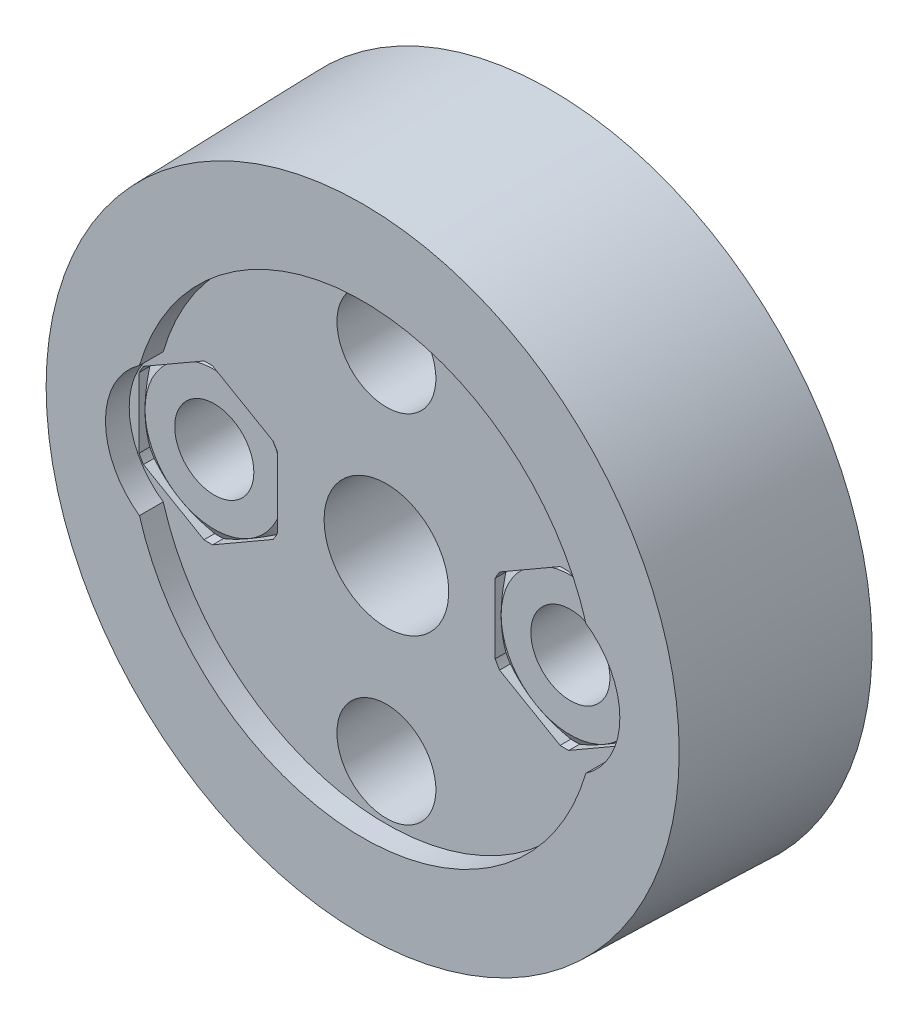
ISO-10303-21;
HEADER;
FILE_DESCRIPTION(('STEP AP214'),'2;1');
FILE_NAME('part.step','',(''),(''),'','','');
FILE_SCHEMA(('AUTOMOTIVE_DESIGN { 1 0 10303 214 1 1 1 1 }'));
ENDSEC;
DATA;
#1=APPLICATION_CONTEXT('core data for automotive mechanical design processes');
#2=APPLICATION_PROTOCOL_DEFINITION('international standard','automotive_design',2000,#1);
#3=PRODUCT_CONTEXT('',#1,'mechanical');
#4=PRODUCT('Part','Part','',(#3));
#5=PRODUCT_RELATED_PRODUCT_CATEGORY('part','',(#4));
#6=PRODUCT_DEFINITION_FORMATION('','',#4);
#7=PRODUCT_DEFINITION_CONTEXT('part definition',#1,'design');
#8=PRODUCT_DEFINITION('design','',#6,#7);
#9=PRODUCT_DEFINITION_SHAPE('','',#8);
#10=(LENGTH_UNIT() NAMED_UNIT(*) SI_UNIT(.MILLI.,.METRE.));
#11=(NAMED_UNIT(*) PLANE_ANGLE_UNIT() SI_UNIT($,.RADIAN.));
#12=(NAMED_UNIT(*) SI_UNIT($,.STERADIAN.) SOLID_ANGLE_UNIT());
#13=UNCERTAINTY_MEASURE_WITH_UNIT(LENGTH_MEASURE(1.E-05),#10,'distance_accuracy_value','');
#14=(GEOMETRIC_REPRESENTATION_CONTEXT(3) GLOBAL_UNCERTAINTY_ASSIGNED_CONTEXT((#13)) GLOBAL_UNIT_ASSIGNED_CONTEXT((#10,
#11,#12)) REPRESENTATION_CONTEXT('',''));
#15=CARTESIAN_POINT('',(0.,0.,0.));
#16=DIRECTION('',(0.,0.,1.));
#17=DIRECTION('',(1.,0.,0.));
#18=AXIS2_PLACEMENT_3D('',#15,#16,#17);
#19=CARTESIAN_POINT('',(12.5,-1.76533282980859,14.));
#20=DIRECTION('',(-1.,0.,0.));
#21=DIRECTION('',(0.,0.,-1.));
#22=AXIS2_PLACEMENT_3D('',#19,#20,#21);
#23=PLANE('',#22);
#24=DIRECTION('',(0.,0.,-1.));
#25=VECTOR('',#24,1.);
#26=CARTESIAN_POINT('',(12.5,1.76533282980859,14.));
#27=LINE('',#26,#25);
#28=CARTESIAN_POINT('',(12.5,1.76533282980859,8.3));
#29=VERTEX_POINT('',#28);
#30=CARTESIAN_POINT('',(12.5,1.76533282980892,7.75751288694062));
#31=VERTEX_POINT('',#30);
#32=EDGE_CURVE('E561',#29,#31,#27,.T.);
#33=ORIENTED_EDGE('',*,*,#32,.T.);
#34=CARTESIAN_POINT('',(12.5,5.06373872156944,6.46678682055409));
#35=CARTESIAN_POINT('',(12.5,4.91533943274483,6.53724594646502));
#36=CARTESIAN_POINT('',(12.5,4.76656229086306,6.60692491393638));
#37=CARTESIAN_POINT('',(12.5,4.46805324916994,6.74428222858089));
#38=CARTESIAN_POINT('',(12.5,4.31832116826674,6.81196018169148));
#39=CARTESIAN_POINT('',(12.5,4.01684368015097,6.94525287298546));
#40=CARTESIAN_POINT('',(12.5,3.86509156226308,7.01085249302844));
#41=CARTESIAN_POINT('',(12.5,3.56027205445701,7.13890962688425));
#42=CARTESIAN_POINT('',(12.5,3.40720473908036,7.2013673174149));
#43=CARTESIAN_POINT('',(12.5,3.09863359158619,7.32265968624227));
#44=CARTESIAN_POINT('',(12.5,2.94312088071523,7.38147190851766));
#45=CARTESIAN_POINT('',(12.5,2.63022765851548,7.4939946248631));
#46=CARTESIAN_POINT('',(12.5,2.47284695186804,7.54770458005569));
#47=CARTESIAN_POINT('',(12.5,2.15636062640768,7.64848973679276));
#48=CARTESIAN_POINT('',(12.5,1.99725993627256,7.69558024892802));
#49=CARTESIAN_POINT('',(12.5,1.67686260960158,7.78154706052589));
#50=CARTESIAN_POINT('',(12.5,1.51556647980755,7.82042522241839));
#51=CARTESIAN_POINT('',(12.5,1.18612094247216,7.88901028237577));
#52=CARTESIAN_POINT('',(12.5,1.01790824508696,7.91841941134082));
#53=CARTESIAN_POINT('',(12.5,0.679692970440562,7.96443295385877));
#54=CARTESIAN_POINT('',(12.5,0.509690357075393,7.98103710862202));
#55=CARTESIAN_POINT('',(12.5,0.169663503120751,7.99997469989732));
#56=CARTESIAN_POINT('',(12.5,-0.000356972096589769,8.00237403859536));
#57=CARTESIAN_POINT('',(12.5,-0.339957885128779,7.99285268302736));
#58=CARTESIAN_POINT('',(12.5,-0.509538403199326,7.98093481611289));
#59=CARTESIAN_POINT('',(12.5,-0.805683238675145,7.94841341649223));
#60=CARTESIAN_POINT('',(12.5,-0.932574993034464,7.93066497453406));
#61=CARTESIAN_POINT('',(12.5,-1.1852391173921,7.88842040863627));
#62=CARTESIAN_POINT('',(12.5,-1.31101128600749,7.86392309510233));
#63=CARTESIAN_POINT('',(12.5,-1.6869159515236,7.78154723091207));
#64=CARTESIAN_POINT('',(12.5,-1.93512684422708,7.71484748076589));
#65=CARTESIAN_POINT('',(12.5,-2.30593797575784,7.60162990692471));
#66=CARTESIAN_POINT('',(12.5,-2.43051306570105,7.56122945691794));
#67=CARTESIAN_POINT('',(12.5,-2.67846287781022,7.4768357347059));
#68=CARTESIAN_POINT('',(12.5,-2.80183749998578,7.43284216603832));
#69=CARTESIAN_POINT('',(12.5,-3.04676500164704,7.34217034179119));
#70=CARTESIAN_POINT('',(12.5,-3.16832431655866,7.29550930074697));
#71=CARTESIAN_POINT('',(12.5,-3.41044301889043,7.19976733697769));
#72=CARTESIAN_POINT('',(12.5,-3.53100271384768,7.15068719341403));
#73=CARTESIAN_POINT('',(12.5,-3.65114658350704,7.10063054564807));
#74=B_SPLINE_CURVE_WITH_KNOTS('',3,(#34,#35,#36,#37,#38,#39,#40,#41,#42,#43,#44,#45,#46,#47,#48,
#49,#50,#51,#52,#53,#54,#55,#56,#57,#58,#59,#60,#61,#62,#63,#64,#65,#66,#67,#68,#69,#70,#71,#72,
#73),.UNSPECIFIED.,.F.,.F.,(4,2,2,2,2,2,2,2,2,2,2,2,2,2,2,2,2,2,2,4),(0.,0.492837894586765,
0.985772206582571,1.48171584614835,1.97763156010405,2.47634830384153,2.97511766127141,
3.47271369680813,3.97019676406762,4.48206790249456,4.99394938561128,5.50345416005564,
6.01285833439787,6.39704729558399,6.78130401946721,7.55135154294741,7.9442137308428,
8.33710836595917,8.72770413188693,9.11817490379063),.UNSPECIFIED.);
#75=CARTESIAN_POINT('',(12.5,0.,8.));
#76=VERTEX_POINT('',#75);
#77=EDGE_CURVE('E472',#31,#76,#74,.T.);
#78=ORIENTED_EDGE('',*,*,#77,.T.);
#79=CARTESIAN_POINT('',(12.5000000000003,-1.76533282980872,7.75751288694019));
#80=VERTEX_POINT('',#79);
#81=EDGE_CURVE('E464',#76,#80,#74,.T.);
#82=ORIENTED_EDGE('',*,*,#81,.T.);
#83=DIRECTION('',(0.,0.,-1.));
#84=VECTOR('',#83,1.);
#85=CARTESIAN_POINT('',(12.5,-1.76533282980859,14.));
#86=LINE('',#85,#84);
#87=CARTESIAN_POINT('',(12.5,-1.76533282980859,8.3));
#88=VERTEX_POINT('',#87);
#89=EDGE_CURVE('E525',#88,#80,#86,.T.);
#90=ORIENTED_EDGE('',*,*,#89,.F.);
#91=DIRECTION('',(0.,-1.,0.));
#92=VECTOR('',#91,1.);
#93=CARTESIAN_POINT('',(12.5,-3.15,8.3));
#94=LINE('',#93,#92);
#95=EDGE_CURVE('E723',#29,#88,#94,.T.);
#96=ORIENTED_EDGE('',*,*,#95,.F.);
#97=EDGE_LOOP('',(#33,#78,#82,#90,#96));
#98=FACE_BOUND('',#97,.T.);
#99=ADVANCED_FACE('F14',(#98),#23,.T.);
#100=CARTESIAN_POINT('',(8.99999999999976,-1.50053580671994E-13,14.));
#101=DIRECTION('',(0.,0.,-1.));
#102=DIRECTION('',(1.,0.,0.));
#103=AXIS2_PLACEMENT_3D('',#100,#101,#102);
#104=CYLINDRICAL_SURFACE('',#103,3.92000000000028);
#105=DIRECTION('',(0.,0.,-1.));
#106=VECTOR('',#105,1.);
#107=CARTESIAN_POINT('',(12.2788230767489,2.14842249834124,14.));
#108=LINE('',#107,#106);
#109=CARTESIAN_POINT('',(12.2788230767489,2.14842249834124,8.3));
#110=VERTEX_POINT('',#109);
#111=CARTESIAN_POINT('',(12.2788230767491,2.14842249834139,7.7575128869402));
#112=VERTEX_POINT('',#111);
#113=EDGE_CURVE('E558',#110,#112,#108,.T.);
#114=ORIENTED_EDGE('',*,*,#113,.T.);
#115=CARTESIAN_POINT('',(9.,0.,7.7575128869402));
#116=DIRECTION('',(0.,0.,-1.));
#117=DIRECTION('',(1.,0.,0.));
#118=AXIS2_PLACEMENT_3D('',#115,#116,#117);
#119=CIRCLE('',#118,3.92000000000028);
#120=EDGE_CURVE('E487',#112,#31,#119,.T.);
#121=ORIENTED_EDGE('',*,*,#120,.T.);
#122=ORIENTED_EDGE('',*,*,#32,.F.);
#123=CARTESIAN_POINT('',(8.99999999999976,-1.50053580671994E-13,8.3));
#124=DIRECTION('',(0.,0.,1.));
#125=DIRECTION('',(-1.,0.,0.));
#126=AXIS2_PLACEMENT_3D('',#123,#124,#125);
#127=CIRCLE('',#126,3.92000000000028);
#128=EDGE_CURVE('E720',#110,#29,#127,.F.);
#129=ORIENTED_EDGE('',*,*,#128,.F.);
#130=EDGE_LOOP('',(#114,#121,#122,#129));
#131=FACE_BOUND('',#130,.T.);
#132=ADVANCED_FACE('F451',(#131),#104,.F.);
#133=CARTESIAN_POINT('',(12.2788230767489,2.14842249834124,14.));
#134=DIRECTION('',(-0.5,-0.866025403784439,0.));
#135=DIRECTION('',(0.866025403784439,-0.5,0.));
#136=AXIS2_PLACEMENT_3D('',#133,#134,#135);
#137=PLANE('',#136);
#138=DIRECTION('',(0.,0.,-1.));
#139=VECTOR('',#138,1.);
#140=CARTESIAN_POINT('',(9.22117692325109,3.91375532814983,14.));
#141=LINE('',#140,#139);
#142=CARTESIAN_POINT('',(9.22117692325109,3.91375532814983,8.3));
#143=VERTEX_POINT('',#142);
#144=CARTESIAN_POINT('',(9.22117692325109,3.91375532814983,7.75751288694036));
#145=VERTEX_POINT('',#144);
#146=EDGE_CURVE('E555',#143,#145,#141,.T.);
#147=ORIENTED_EDGE('',*,*,#146,.T.);
#148=CARTESIAN_POINT('',(9.22097692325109,3.91387079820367,7.75745283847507));
#149=CARTESIAN_POINT('',(9.29614832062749,3.87047057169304,7.78002139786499));
#150=CARTESIAN_POINT('',(9.37159814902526,3.82690959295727,7.80135049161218));
#151=CARTESIAN_POINT('',(9.52307099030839,3.73945670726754,7.84122532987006));
#152=CARTESIAN_POINT('',(9.59909417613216,3.69556470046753,7.85977019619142));
#153=CARTESIAN_POINT('',(9.82818318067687,3.56330010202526,7.91079717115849));
#154=CARTESIAN_POINT('',(9.98206519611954,3.474456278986,7.93860895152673));
#155=CARTESIAN_POINT('',(10.2879721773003,3.29784080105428,7.97904770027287));
#156=CARTESIAN_POINT('',(10.4399653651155,3.2100874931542,7.99198996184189));
#157=CARTESIAN_POINT('',(10.7442349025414,3.03441739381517,8.00253005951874));
#158=CARTESIAN_POINT('',(10.8965108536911,2.94650083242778,8.0001422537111));
#159=CARTESIAN_POINT('',(11.1515374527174,2.7992611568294,7.98350174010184));
#160=CARTESIAN_POINT('',(11.2545045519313,2.73981307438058,7.97330106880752));
#161=CARTESIAN_POINT('',(11.4598371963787,2.6212642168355,7.94641300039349));
#162=CARTESIAN_POINT('',(11.5622025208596,2.56216356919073,7.92972335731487));
#163=CARTESIAN_POINT('',(11.7676145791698,2.44356886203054,7.8901844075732));
#164=CARTESIAN_POINT('',(11.870648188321,2.38408238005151,7.86724572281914));
#165=CARTESIAN_POINT('',(12.0756414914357,2.26572944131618,7.81610600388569));
#166=CARTESIAN_POINT('',(12.1776020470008,2.20686248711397,7.78790959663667));
#167=CARTESIAN_POINT('',(12.2790230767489,2.1483070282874,7.75745283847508));
#168=B_SPLINE_CURVE_WITH_KNOTS('',3,(#148,#149,#150,#151,#152,#153,#154,#155,#156,#157,#158,
#159,#160,#161,#162,#163,#164,#165,#166,#167),.UNSPECIFIED.,.F.,.F.,(4,2,2,2,2,2,2,2,2,4),(0.,
0.269043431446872,0.538171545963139,1.07715508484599,1.60448589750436,2.13132288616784,
2.48914897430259,2.84709902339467,3.21046504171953,3.57351278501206),.UNSPECIFIED.);
#169=CARTESIAN_POINT('',(10.75,3.03108891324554,8.));
#170=VERTEX_POINT('',#169);
#171=EDGE_CURVE('E247',#145,#170,#168,.T.);
#172=ORIENTED_EDGE('',*,*,#171,.T.);
#173=EDGE_CURVE('E274',#170,#112,#168,.T.);
#174=ORIENTED_EDGE('',*,*,#173,.T.);
#175=ORIENTED_EDGE('',*,*,#113,.F.);
#176=DIRECTION('',(0.866025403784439,-0.5,0.));
#177=VECTOR('',#176,1.);
#178=CARTESIAN_POINT('',(5.36399001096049,6.14070323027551,8.3));
#179=LINE('',#178,#177);
#180=EDGE_CURVE('E717',#143,#110,#179,.T.);
#181=ORIENTED_EDGE('',*,*,#180,.F.);
#182=EDGE_LOOP('',(#147,#172,#174,#175,#181));
#183=FACE_BOUND('',#182,.T.);
#184=ADVANCED_FACE('F457',(#183),#137,.T.);
#185=CARTESIAN_POINT('',(9.,-1.96891114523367E-13,14.));
#186=DIRECTION('',(0.,0.,-1.));
#187=DIRECTION('',(1.,0.,0.));
#188=AXIS2_PLACEMENT_3D('',#185,#186,#187);
#189=CYLINDRICAL_SURFACE('',#188,3.92000000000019);
#190=DIRECTION('',(0.,0.,-1.));
#191=VECTOR('',#190,1.);
#192=CARTESIAN_POINT('',(8.77882307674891,3.91375532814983,14.));
#193=LINE('',#192,#191);
#194=CARTESIAN_POINT('',(8.77882307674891,3.91375532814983,8.3));
#195=VERTEX_POINT('',#194);
#196=CARTESIAN_POINT('',(8.7788230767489,3.91375532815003,7.75751288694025));
#197=VERTEX_POINT('',#196);
#198=EDGE_CURVE('E552',#195,#197,#193,.T.);
#199=ORIENTED_EDGE('',*,*,#198,.T.);
#200=CARTESIAN_POINT('',(9.,0.,7.75751288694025));
#201=DIRECTION('',(0.,0.,-1.));
#202=DIRECTION('',(1.,0.,0.));
#203=AXIS2_PLACEMENT_3D('',#200,#201,#202);
#204=CIRCLE('',#203,3.92000000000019);
#205=EDGE_CURVE('E319',#197,#145,#204,.T.);
#206=ORIENTED_EDGE('',*,*,#205,.T.);
#207=ORIENTED_EDGE('',*,*,#146,.F.);
#208=CARTESIAN_POINT('',(9.,-1.96891114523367E-13,8.3));
#209=DIRECTION('',(0.,0.,1.));
#210=DIRECTION('',(-1.,0.,0.));
#211=AXIS2_PLACEMENT_3D('',#208,#209,#210);
#212=CIRCLE('',#211,3.92000000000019);
#213=EDGE_CURVE('E714',#195,#143,#212,.F.);
#214=ORIENTED_EDGE('',*,*,#213,.F.);
#215=EDGE_LOOP('',(#199,#206,#207,#214));
#216=FACE_BOUND('',#215,.T.);
#217=ADVANCED_FACE('F310',(#216),#189,.F.);
#218=CARTESIAN_POINT('',(8.77882307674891,3.91375532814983,14.));
#219=DIRECTION('',(0.5,-0.866025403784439,0.));
#220=DIRECTION('',(0.866025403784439,0.5,0.));
#221=AXIS2_PLACEMENT_3D('',#218,#219,#220);
#222=PLANE('',#221);
#223=DIRECTION('',(0.,0.,-1.));
#224=VECTOR('',#223,1.);
#225=CARTESIAN_POINT('',(5.72117692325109,2.14842249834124,14.));
#226=LINE('',#225,#224);
#227=CARTESIAN_POINT('',(5.72117692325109,2.14842249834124,8.3));
#228=VERTEX_POINT('',#227);
#229=CARTESIAN_POINT('',(5.72117692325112,2.14842249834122,7.75751288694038));
#230=VERTEX_POINT('',#229);
#231=EDGE_CURVE('E549',#228,#230,#226,.T.);
#232=ORIENTED_EDGE('',*,*,#231,.T.);
#233=CARTESIAN_POINT('',(5.72097692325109,2.1483070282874,7.75745283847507));
#234=CARTESIAN_POINT('',(5.7961483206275,2.19170725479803,7.78002139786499));
#235=CARTESIAN_POINT('',(5.87159814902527,2.23526823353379,7.80135049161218));
#236=CARTESIAN_POINT('',(6.0230709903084,2.32272111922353,7.84122532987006));
#237=CARTESIAN_POINT('',(6.09909417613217,2.36661312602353,7.85977019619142));
#238=CARTESIAN_POINT('',(6.32818318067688,2.49887772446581,7.91079717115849));
#239=CARTESIAN_POINT('',(6.48206519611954,2.58772154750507,7.93860895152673));
#240=CARTESIAN_POINT('',(6.78797217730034,2.76433702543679,7.97904770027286));
#241=CARTESIAN_POINT('',(6.93996536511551,2.85209033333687,7.99198996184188));
#242=CARTESIAN_POINT('',(7.24423490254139,3.0277604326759,8.00253005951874));
#243=CARTESIAN_POINT('',(7.3965108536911,3.11567699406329,8.00014225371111));
#244=CARTESIAN_POINT('',(7.65153745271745,3.26291666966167,7.98350174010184));
#245=CARTESIAN_POINT('',(7.75450455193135,3.32236475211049,7.97330106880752));
#246=CARTESIAN_POINT('',(7.95983719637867,3.44091360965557,7.94641300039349));
#247=CARTESIAN_POINT('',(8.06220252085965,3.50001425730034,7.92972335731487));
#248=CARTESIAN_POINT('',(8.26761457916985,3.61860896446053,7.8901844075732));
#249=CARTESIAN_POINT('',(8.37064818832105,3.67809544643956,7.86724572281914));
#250=CARTESIAN_POINT('',(8.57564149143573,3.79644838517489,7.81610600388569));
#251=CARTESIAN_POINT('',(8.67760204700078,3.8553153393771,7.78790959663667));
#252=CARTESIAN_POINT('',(8.77902307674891,3.91387079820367,7.75745283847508));
#253=B_SPLINE_CURVE_WITH_KNOTS('',3,(#233,#234,#235,#236,#237,#238,#239,#240,#241,#242,#243,
#244,#245,#246,#247,#248,#249,#250,#251,#252),.UNSPECIFIED.,.F.,.F.,(4,2,2,2,2,2,2,2,2,4),(0.,
0.269043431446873,0.538171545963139,1.07715508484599,1.60448589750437,2.13132288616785,
2.4891489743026,2.84709902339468,3.21046504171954,3.57351278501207),.UNSPECIFIED.);
#254=CARTESIAN_POINT('',(7.25,3.03108891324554,8.));
#255=VERTEX_POINT('',#254);
#256=EDGE_CURVE('E313',#230,#255,#253,.T.);
#257=ORIENTED_EDGE('',*,*,#256,.T.);
#258=EDGE_CURVE('E320',#255,#197,#253,.T.);
#259=ORIENTED_EDGE('',*,*,#258,.T.);
#260=ORIENTED_EDGE('',*,*,#198,.F.);
#261=DIRECTION('',(0.866025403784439,0.5,0.));
#262=VECTOR('',#261,1.);
#263=CARTESIAN_POINT('',(-0.863990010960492,-1.65352540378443,8.3));
#264=LINE('',#263,#262);
#265=EDGE_CURVE('E711',#228,#195,#264,.T.);
#266=ORIENTED_EDGE('',*,*,#265,.F.);
#267=EDGE_LOOP('',(#232,#257,#259,#260,#266));
#268=FACE_BOUND('',#267,.T.);
#269=ADVANCED_FACE('F305',(#268),#222,.T.);
#270=CARTESIAN_POINT('',(9.,0.,14.));
#271=DIRECTION('',(0.,0.,-1.));
#272=DIRECTION('',(1.,0.,0.));
#273=AXIS2_PLACEMENT_3D('',#270,#271,#272);
#274=CYLINDRICAL_SURFACE('',#273,3.92);
#275=DIRECTION('',(0.,0.,-1.));
#276=VECTOR('',#275,1.);
#277=CARTESIAN_POINT('',(5.5,1.76533282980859,14.));
#278=LINE('',#277,#276);
#279=CARTESIAN_POINT('',(5.5,1.76533282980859,8.3));
#280=VERTEX_POINT('',#279);
#281=CARTESIAN_POINT('',(5.5,1.76533282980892,7.75751288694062));
#282=VERTEX_POINT('',#281);
#283=EDGE_CURVE('E547',#280,#282,#278,.T.);
#284=ORIENTED_EDGE('',*,*,#283,.T.);
#285=CARTESIAN_POINT('',(9.,0.,7.75751288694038));
#286=DIRECTION('',(0.,0.,-1.));
#287=DIRECTION('',(1.,0.,0.));
#288=AXIS2_PLACEMENT_3D('',#285,#286,#287);
#289=CIRCLE('',#288,3.92);
#290=EDGE_CURVE('E242',#282,#230,#289,.T.);
#291=ORIENTED_EDGE('',*,*,#290,.T.);
#292=ORIENTED_EDGE('',*,*,#231,.F.);
#293=CARTESIAN_POINT('',(9.,0.,8.3));
#294=DIRECTION('',(0.,0.,1.));
#295=DIRECTION('',(-1.,0.,0.));
#296=AXIS2_PLACEMENT_3D('',#293,#294,#295);
#297=CIRCLE('',#296,3.92);
#298=EDGE_CURVE('E708',#280,#228,#297,.F.);
#299=ORIENTED_EDGE('',*,*,#298,.F.);
#300=EDGE_LOOP('',(#284,#291,#292,#299));
#301=FACE_BOUND('',#300,.T.);
#302=ADVANCED_FACE('F301',(#301),#274,.F.);
#303=CARTESIAN_POINT('',(5.5,1.76533282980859,14.));
#304=DIRECTION('',(1.,0.,0.));
#305=DIRECTION('',(0.,0.,1.));
#306=AXIS2_PLACEMENT_3D('',#303,#304,#305);
#307=PLANE('',#306);
#308=DIRECTION('',(0.,0.,-1.));
#309=VECTOR('',#308,1.);
#310=CARTESIAN_POINT('',(5.5,-1.76533282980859,14.));
#311=LINE('',#310,#309);
#312=CARTESIAN_POINT('',(5.5,-1.76533282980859,8.3));
#313=VERTEX_POINT('',#312);
#314=CARTESIAN_POINT('',(5.49999999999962,-1.76533282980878,7.75751288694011));
#315=VERTEX_POINT('',#314);
#316=EDGE_CURVE('E273',#313,#315,#311,.T.);
#317=ORIENTED_EDGE('',*,*,#316,.T.);
#318=CARTESIAN_POINT('',(5.5,5.06373872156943,6.46678682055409));
#319=CARTESIAN_POINT('',(5.5,4.91533943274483,6.53724594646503));
#320=CARTESIAN_POINT('',(5.5,4.76656229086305,6.60692491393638));
#321=CARTESIAN_POINT('',(5.5,4.46805324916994,6.74428222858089));
#322=CARTESIAN_POINT('',(5.5,4.31832116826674,6.81196018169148));
#323=CARTESIAN_POINT('',(5.5,4.01684368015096,6.94525287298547));
#324=CARTESIAN_POINT('',(5.5,3.86509156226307,7.01085249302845));
#325=CARTESIAN_POINT('',(5.5,3.56027205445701,7.13890962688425));
#326=CARTESIAN_POINT('',(5.5,3.40720473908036,7.2013673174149));
#327=CARTESIAN_POINT('',(5.5,3.09863359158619,7.32265968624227));
#328=CARTESIAN_POINT('',(5.5,2.94312088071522,7.38147190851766));
#329=CARTESIAN_POINT('',(5.5,2.63022765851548,7.4939946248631));
#330=CARTESIAN_POINT('',(5.5,2.47284695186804,7.54770458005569));
#331=CARTESIAN_POINT('',(5.5,2.15636062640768,7.64848973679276));
#332=CARTESIAN_POINT('',(5.5,1.99725993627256,7.69558024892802));
#333=CARTESIAN_POINT('',(5.5,1.67686260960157,7.78154706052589));
#334=CARTESIAN_POINT('',(5.5,1.51556647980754,7.82042522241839));
#335=CARTESIAN_POINT('',(5.5,1.18612094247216,7.88901028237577));
#336=CARTESIAN_POINT('',(5.5,1.01790824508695,7.91841941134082));
#337=CARTESIAN_POINT('',(5.5,0.679692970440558,7.96443295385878));
#338=CARTESIAN_POINT('',(5.5,0.509690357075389,7.98103710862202));
#339=CARTESIAN_POINT('',(5.5,0.169663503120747,7.99997469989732));
#340=CARTESIAN_POINT('',(5.5,-0.000356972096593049,8.00237403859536));
#341=CARTESIAN_POINT('',(5.5,-0.339957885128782,7.99285268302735));
#342=CARTESIAN_POINT('',(5.5,-0.509538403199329,7.98093481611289));
#343=CARTESIAN_POINT('',(5.5,-0.805683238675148,7.94841341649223));
#344=CARTESIAN_POINT('',(5.5,-0.932574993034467,7.93066497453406));
#345=CARTESIAN_POINT('',(5.5,-1.1852391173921,7.88842040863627));
#346=CARTESIAN_POINT('',(5.5,-1.31101128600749,7.86392309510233));
#347=CARTESIAN_POINT('',(5.5,-1.6869159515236,7.78154723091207));
#348=CARTESIAN_POINT('',(5.5,-1.93512684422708,7.71484748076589));
#349=CARTESIAN_POINT('',(5.5,-2.30593797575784,7.60162990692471));
#350=CARTESIAN_POINT('',(5.5,-2.43051306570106,7.56122945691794));
#351=CARTESIAN_POINT('',(5.5,-2.67846287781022,7.4768357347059));
#352=CARTESIAN_POINT('',(5.5,-2.80183749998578,7.43284216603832));
#353=CARTESIAN_POINT('',(5.5,-3.04676500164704,7.34217034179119));
#354=CARTESIAN_POINT('',(5.5,-3.16832431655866,7.29550930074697));
#355=CARTESIAN_POINT('',(5.5,-3.41044301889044,7.19976733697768));
#356=CARTESIAN_POINT('',(5.5,-3.53100271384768,7.15068719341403));
#357=CARTESIAN_POINT('',(5.5,-3.65114658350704,7.10063054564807));
#358=B_SPLINE_CURVE_WITH_KNOTS('',3,(#318,#319,#320,#321,#322,#323,#324,#325,#326,#327,#328,
#329,#330,#331,#332,#333,#334,#335,#336,#337,#338,#339,#340,#341,#342,#343,#344,#345,#346,#347,
#348,#349,#350,#351,#352,#353,#354,#355,#356,#357),.UNSPECIFIED.,.F.,.F.,(4,2,2,2,2,2,2,2,2,2,2,
2,2,2,2,2,2,2,2,4),(0.,0.492837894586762,0.985772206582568,1.48171584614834,1.97763156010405,
2.47634830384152,2.9751176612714,3.47271369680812,3.97019676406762,4.48206790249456,
4.99394938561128,5.50345416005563,6.01285833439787,6.39704729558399,6.7813040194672,
7.55135154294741,7.9442137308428,8.33710836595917,8.72770413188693,9.11817490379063),.UNSPECIFIED.);
#359=CARTESIAN_POINT('',(5.5,0.,8.));
#360=VERTEX_POINT('',#359);
#361=EDGE_CURVE('E249',#315,#360,#358,.F.);
#362=ORIENTED_EDGE('',*,*,#361,.T.);
#363=EDGE_CURVE('E236',#360,#282,#358,.F.);
#364=ORIENTED_EDGE('',*,*,#363,.T.);
#365=ORIENTED_EDGE('',*,*,#283,.F.);
#366=DIRECTION('',(0.,1.,0.));
#367=VECTOR('',#366,1.);
#368=CARTESIAN_POINT('',(5.5,-3.15,8.3));
#369=LINE('',#368,#367);
#370=EDGE_CURVE('E705',#313,#280,#369,.T.);
#371=ORIENTED_EDGE('',*,*,#370,.F.);
#372=EDGE_LOOP('',(#317,#362,#364,#365,#371));
#373=FACE_BOUND('',#372,.T.);
#374=ADVANCED_FACE('F271',(#373),#307,.T.);
#375=CARTESIAN_POINT('',(9.00000000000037,2.22478285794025E-13,14.));
#376=DIRECTION('',(0.,0.,-1.));
#377=DIRECTION('',(1.,0.,0.));
#378=AXIS2_PLACEMENT_3D('',#375,#376,#377);
#379=CYLINDRICAL_SURFACE('',#378,3.92000000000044);
#380=DIRECTION('',(0.,0.,-1.));
#381=VECTOR('',#380,1.);
#382=CARTESIAN_POINT('',(5.72117692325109,-2.14842249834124,14.));
#383=LINE('',#382,#381);
#384=CARTESIAN_POINT('',(5.72117692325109,-2.14842249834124,8.3));
#385=VERTEX_POINT('',#384);
#386=CARTESIAN_POINT('',(5.72117692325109,-2.14842249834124,7.75751288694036));
#387=VERTEX_POINT('',#386);
#388=EDGE_CURVE('E543',#385,#387,#383,.T.);
#389=ORIENTED_EDGE('',*,*,#388,.T.);
#390=CARTESIAN_POINT('',(9.,0.,7.75751288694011));
#391=DIRECTION('',(0.,0.,-1.));
#392=DIRECTION('',(1.,0.,0.));
#393=AXIS2_PLACEMENT_3D('',#390,#391,#392);
#394=CIRCLE('',#393,3.92000000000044);
#395=EDGE_CURVE('E275',#387,#315,#394,.T.);
#396=ORIENTED_EDGE('',*,*,#395,.T.);
#397=ORIENTED_EDGE('',*,*,#316,.F.);
#398=CARTESIAN_POINT('',(9.00000000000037,2.22478285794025E-13,8.3));
#399=DIRECTION('',(0.,0.,1.));
#400=DIRECTION('',(-1.,0.,0.));
#401=AXIS2_PLACEMENT_3D('',#398,#399,#400);
#402=CIRCLE('',#401,3.92000000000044);
#403=EDGE_CURVE('E702',#385,#313,#402,.F.);
#404=ORIENTED_EDGE('',*,*,#403,.F.);
#405=EDGE_LOOP('',(#389,#396,#397,#404));
#406=FACE_BOUND('',#405,.T.);
#407=ADVANCED_FACE('F300',(#406),#379,.F.);
#408=CARTESIAN_POINT('',(5.72117692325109,-2.14842249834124,14.));
#409=DIRECTION('',(0.5,0.866025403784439,0.));
#410=DIRECTION('',(-0.866025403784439,0.5,0.));
#411=AXIS2_PLACEMENT_3D('',#408,#409,#410);
#412=PLANE('',#411);
#413=DIRECTION('',(0.,0.,-1.));
#414=VECTOR('',#413,1.);
#415=CARTESIAN_POINT('',(8.77882307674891,-3.91375532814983,14.));
#416=LINE('',#415,#414);
#417=CARTESIAN_POINT('',(8.77882307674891,-3.91375532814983,8.3));
#418=VERTEX_POINT('',#417);
#419=CARTESIAN_POINT('',(8.77882307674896,-3.91375532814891,7.75751288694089));
#420=VERTEX_POINT('',#419);
#421=EDGE_CURVE('E540',#418,#420,#416,.T.);
#422=ORIENTED_EDGE('',*,*,#421,.T.);
#423=CARTESIAN_POINT('',(8.77902307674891,-3.91387079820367,7.75745283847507));
#424=CARTESIAN_POINT('',(8.70385167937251,-3.87047057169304,7.78002139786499));
#425=CARTESIAN_POINT('',(8.62840185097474,-3.82690959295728,7.80135049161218));
#426=CARTESIAN_POINT('',(8.47692900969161,-3.73945670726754,7.84122532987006));
#427=CARTESIAN_POINT('',(8.40090582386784,-3.69556470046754,7.85977019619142));
#428=CARTESIAN_POINT('',(8.17181681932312,-3.56330010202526,7.91079717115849));
#429=CARTESIAN_POINT('',(8.01793480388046,-3.474456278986,7.93860895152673));
#430=CARTESIAN_POINT('',(7.71202782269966,-3.29784080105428,7.97904770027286));
#431=CARTESIAN_POINT('',(7.56003463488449,-3.2100874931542,7.99198996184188));
#432=CARTESIAN_POINT('',(7.25576509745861,-3.03441739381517,8.00253005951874));
#433=CARTESIAN_POINT('',(7.1034891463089,-2.94650083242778,8.00014225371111));
#434=CARTESIAN_POINT('',(6.84846254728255,-2.7992611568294,7.98350174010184));
#435=CARTESIAN_POINT('',(6.74549544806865,-2.73981307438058,7.97330106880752));
#436=CARTESIAN_POINT('',(6.54016280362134,-2.6212642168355,7.94641300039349));
#437=CARTESIAN_POINT('',(6.43779747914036,-2.56216356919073,7.92972335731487));
#438=CARTESIAN_POINT('',(6.23238542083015,-2.44356886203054,7.8901844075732));
#439=CARTESIAN_POINT('',(6.12935181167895,-2.38408238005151,7.86724572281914));
#440=CARTESIAN_POINT('',(5.92435850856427,-2.26572944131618,7.81610600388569));
#441=CARTESIAN_POINT('',(5.82239795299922,-2.20686248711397,7.78790959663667));
#442=CARTESIAN_POINT('',(5.72097692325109,-2.1483070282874,7.75745283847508));
#443=B_SPLINE_CURVE_WITH_KNOTS('',3,(#423,#424,#425,#426,#427,#428,#429,#430,#431,#432,#433,
#434,#435,#436,#437,#438,#439,#440,#441,#442),.UNSPECIFIED.,.F.,.F.,(4,2,2,2,2,2,2,2,2,4),(0.,
0.269043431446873,0.53817154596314,1.07715508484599,1.60448589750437,2.13132288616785,
2.4891489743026,2.84709902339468,3.21046504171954,3.57351278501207),.UNSPECIFIED.);
#444=CARTESIAN_POINT('',(7.25,-3.03108891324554,8.));
#445=VERTEX_POINT('',#444);
#446=EDGE_CURVE('E481',#420,#445,#443,.T.);
#447=ORIENTED_EDGE('',*,*,#446,.T.);
#448=EDGE_CURVE('E267',#445,#387,#443,.T.);
#449=ORIENTED_EDGE('',*,*,#448,.T.);
#450=ORIENTED_EDGE('',*,*,#388,.F.);
#451=DIRECTION('',(-0.866025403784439,0.5,0.));
#452=VECTOR('',#451,1.);
#453=CARTESIAN_POINT('',(1.86399001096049,0.078525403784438,8.3));
#454=LINE('',#453,#452);
#455=EDGE_CURVE('E699',#418,#385,#454,.T.);
#456=ORIENTED_EDGE('',*,*,#455,.F.);
#457=EDGE_LOOP('',(#422,#447,#449,#450,#456));
#458=FACE_BOUND('',#457,.T.);
#459=ADVANCED_FACE('F488',(#458),#412,.T.);
#460=CARTESIAN_POINT('',(9.,-9.22872889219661E-13,14.));
#461=DIRECTION('',(0.,0.,-1.));
#462=DIRECTION('',(1.,0.,0.));
#463=AXIS2_PLACEMENT_3D('',#460,#461,#462);
#464=CYLINDRICAL_SURFACE('',#463,3.91999999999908);
#465=DIRECTION('',(0.,0.,-1.));
#466=VECTOR('',#465,1.);
#467=CARTESIAN_POINT('',(9.22117692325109,-3.91375532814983,14.));
#468=LINE('',#467,#466);
#469=CARTESIAN_POINT('',(9.22117692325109,-3.91375532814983,8.3));
#470=VERTEX_POINT('',#469);
#471=CARTESIAN_POINT('',(9.22117692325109,-3.91375532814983,7.75751288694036));
#472=VERTEX_POINT('',#471);
#473=EDGE_CURVE('E537',#470,#472,#468,.T.);
#474=ORIENTED_EDGE('',*,*,#473,.T.);
#475=CARTESIAN_POINT('',(9.,0.,7.75751288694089));
#476=DIRECTION('',(0.,0.,-1.));
#477=DIRECTION('',(1.,0.,0.));
#478=AXIS2_PLACEMENT_3D('',#475,#476,#477);
#479=CIRCLE('',#478,3.91999999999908);
#480=EDGE_CURVE('E478',#472,#420,#479,.T.);
#481=ORIENTED_EDGE('',*,*,#480,.T.);
#482=ORIENTED_EDGE('',*,*,#421,.F.);
#483=CARTESIAN_POINT('',(9.,-9.22872889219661E-13,8.3));
#484=DIRECTION('',(0.,0.,1.));
#485=DIRECTION('',(-1.,0.,0.));
#486=AXIS2_PLACEMENT_3D('',#483,#484,#485);
#487=CIRCLE('',#486,3.91999999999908);
#488=EDGE_CURVE('E696',#470,#418,#487,.F.);
#489=ORIENTED_EDGE('',*,*,#488,.F.);
#490=EDGE_LOOP('',(#474,#481,#482,#489));
#491=FACE_BOUND('',#490,.T.);
#492=ADVANCED_FACE('F492',(#491),#464,.F.);
#493=CARTESIAN_POINT('',(9.22117692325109,-3.91375532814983,14.));
#494=DIRECTION('',(-0.5,0.866025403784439,0.));
#495=DIRECTION('',(-0.866025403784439,-0.5,0.));
#496=AXIS2_PLACEMENT_3D('',#493,#494,#495);
#497=PLANE('',#496);
#498=DIRECTION('',(0.,0.,-1.));
#499=VECTOR('',#498,1.);
#500=CARTESIAN_POINT('',(12.2788230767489,-2.14842249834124,14.));
#501=LINE('',#500,#499);
#502=CARTESIAN_POINT('',(12.2788230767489,-2.14842249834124,8.3));
#503=VERTEX_POINT('',#502);
#504=CARTESIAN_POINT('',(12.2788230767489,-2.14842249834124,7.75751288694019));
#505=VERTEX_POINT('',#504);
#506=EDGE_CURVE('E534',#503,#505,#501,.T.);
#507=ORIENTED_EDGE('',*,*,#506,.T.);
#508=CARTESIAN_POINT('',(12.2790230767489,-2.1483070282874,7.75745283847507));
#509=CARTESIAN_POINT('',(12.2038516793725,-2.19170725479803,7.78002139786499));
#510=CARTESIAN_POINT('',(12.1284018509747,-2.2352682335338,7.80135049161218));
#511=CARTESIAN_POINT('',(11.9769290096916,-2.32272111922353,7.84122532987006));
#512=CARTESIAN_POINT('',(11.9009058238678,-2.36661312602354,7.85977019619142));
#513=CARTESIAN_POINT('',(11.6718168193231,-2.49887772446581,7.91079717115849));
#514=CARTESIAN_POINT('',(11.5179348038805,-2.58772154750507,7.93860895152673));
#515=CARTESIAN_POINT('',(11.2120278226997,-2.76433702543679,7.97904770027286));
#516=CARTESIAN_POINT('',(11.0600346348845,-2.85209033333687,7.99198996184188));
#517=CARTESIAN_POINT('',(10.7557650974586,-3.0277604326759,8.00253005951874));
#518=CARTESIAN_POINT('',(10.6034891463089,-3.11567699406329,8.00014225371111));
#519=CARTESIAN_POINT('',(10.3484625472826,-3.26291666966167,7.98350174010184));
#520=CARTESIAN_POINT('',(10.2454954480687,-3.32236475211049,7.97330106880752));
#521=CARTESIAN_POINT('',(10.0401628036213,-3.44091360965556,7.94641300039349));
#522=CARTESIAN_POINT('',(9.93779747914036,-3.50001425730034,7.92972335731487));
#523=CARTESIAN_POINT('',(9.73238542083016,-3.61860896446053,7.8901844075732));
#524=CARTESIAN_POINT('',(9.62935181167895,-3.67809544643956,7.86724572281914));
#525=CARTESIAN_POINT('',(9.42435850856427,-3.79644838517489,7.81610600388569));
#526=CARTESIAN_POINT('',(9.32239795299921,-3.8553153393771,7.78790959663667));
#527=CARTESIAN_POINT('',(9.22097692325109,-3.91387079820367,7.75745283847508));
#528=B_SPLINE_CURVE_WITH_KNOTS('',3,(#508,#509,#510,#511,#512,#513,#514,#515,#516,#517,#518,
#519,#520,#521,#522,#523,#524,#525,#526,#527),.UNSPECIFIED.,.F.,.F.,(4,2,2,2,2,2,2,2,2,4),(0.,
0.269043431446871,0.538171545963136,1.07715508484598,1.60448589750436,2.13132288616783,
2.48914897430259,2.84709902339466,3.21046504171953,3.57351278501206),.UNSPECIFIED.);
#529=CARTESIAN_POINT('',(10.75,-3.03108891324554,8.));
#530=VERTEX_POINT('',#529);
#531=EDGE_CURVE('E29',#505,#530,#528,.T.);
#532=ORIENTED_EDGE('',*,*,#531,.T.);
#533=EDGE_CURVE('E482',#530,#472,#528,.T.);
#534=ORIENTED_EDGE('',*,*,#533,.T.);
#535=ORIENTED_EDGE('',*,*,#473,.F.);
#536=DIRECTION('',(-0.866025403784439,-0.5,0.));
#537=VECTOR('',#536,1.);
#538=CARTESIAN_POINT('',(2.6360099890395,-7.71570323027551,8.3));
#539=LINE('',#538,#537);
#540=EDGE_CURVE('E693',#503,#470,#539,.T.);
#541=ORIENTED_EDGE('',*,*,#540,.F.);
#542=EDGE_LOOP('',(#507,#532,#534,#535,#541));
#543=FACE_BOUND('',#542,.T.);
#544=ADVANCED_FACE('F495',(#543),#497,.T.);
#545=CARTESIAN_POINT('',(8.99999999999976,1.54390389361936E-13,14.));
#546=DIRECTION('',(0.,0.,-1.));
#547=DIRECTION('',(1.,0.,0.));
#548=AXIS2_PLACEMENT_3D('',#545,#546,#547);
#549=CYLINDRICAL_SURFACE('',#548,3.92000000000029);
#550=ORIENTED_EDGE('',*,*,#89,.T.);
#551=CARTESIAN_POINT('',(9.,0.,7.75751288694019));
#552=DIRECTION('',(0.,0.,-1.));
#553=DIRECTION('',(1.,0.,0.));
#554=AXIS2_PLACEMENT_3D('',#551,#552,#553);
#555=CIRCLE('',#554,3.92000000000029);
#556=EDGE_CURVE('E9',#80,#505,#555,.T.);
#557=ORIENTED_EDGE('',*,*,#556,.T.);
#558=ORIENTED_EDGE('',*,*,#506,.F.);
#559=CARTESIAN_POINT('',(8.99999999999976,1.54390389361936E-13,8.3));
#560=DIRECTION('',(0.,0.,1.));
#561=DIRECTION('',(-1.,0.,0.));
#562=AXIS2_PLACEMENT_3D('',#559,#560,#561);
#563=CIRCLE('',#562,3.92000000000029);
#564=EDGE_CURVE('E690',#88,#503,#563,.F.);
#565=ORIENTED_EDGE('',*,*,#564,.F.);
#566=EDGE_LOOP('',(#550,#557,#558,#565));
#567=FACE_BOUND('',#566,.T.);
#568=ADVANCED_FACE('F405',(#567),#549,.F.);
#569=CARTESIAN_POINT('',(-5.5,-1.76533282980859,14.));
#570=DIRECTION('',(-1.,0.,0.));
#571=DIRECTION('',(0.,0.,-1.));
#572=AXIS2_PLACEMENT_3D('',#569,#570,#571);
#573=PLANE('',#572);
#574=DIRECTION('',(0.,0.,-1.));
#575=VECTOR('',#574,1.);
#576=CARTESIAN_POINT('',(-5.5,1.76533282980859,14.));
#577=LINE('',#576,#575);
#578=CARTESIAN_POINT('',(-5.5,1.76533282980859,8.3));
#579=VERTEX_POINT('',#578);
#580=CARTESIAN_POINT('',(-5.5,1.76533282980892,7.75751288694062));
#581=VERTEX_POINT('',#580);
#582=EDGE_CURVE('E596',#579,#581,#577,.T.);
#583=ORIENTED_EDGE('',*,*,#582,.T.);
#584=CARTESIAN_POINT('',(-5.5,5.06373872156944,6.46678682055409));
#585=CARTESIAN_POINT('',(-5.5,4.91533943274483,6.53724594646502));
#586=CARTESIAN_POINT('',(-5.5,4.76656229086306,6.60692491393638));
#587=CARTESIAN_POINT('',(-5.5,4.46805324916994,6.74428222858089));
#588=CARTESIAN_POINT('',(-5.5,4.31832116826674,6.81196018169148));
#589=CARTESIAN_POINT('',(-5.5,4.01684368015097,6.94525287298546));
#590=CARTESIAN_POINT('',(-5.5,3.86509156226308,7.01085249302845));
#591=CARTESIAN_POINT('',(-5.5,3.56027205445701,7.13890962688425));
#592=CARTESIAN_POINT('',(-5.5,3.40720473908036,7.2013673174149));
#593=CARTESIAN_POINT('',(-5.5,3.09863359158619,7.32265968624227));
#594=CARTESIAN_POINT('',(-5.5,2.94312088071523,7.38147190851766));
#595=CARTESIAN_POINT('',(-5.5,2.63022765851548,7.4939946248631));
#596=CARTESIAN_POINT('',(-5.5,2.47284695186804,7.54770458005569));
#597=CARTESIAN_POINT('',(-5.5,2.15636062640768,7.64848973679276));
#598=CARTESIAN_POINT('',(-5.5,1.99725993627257,7.69558024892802));
#599=CARTESIAN_POINT('',(-5.5,1.67686260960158,7.78154706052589));
#600=CARTESIAN_POINT('',(-5.5,1.51556647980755,7.82042522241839));
#601=CARTESIAN_POINT('',(-5.5,1.18612094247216,7.88901028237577));
#602=CARTESIAN_POINT('',(-5.5,1.01790824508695,7.91841941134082));
#603=CARTESIAN_POINT('',(-5.5,0.67969297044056,7.96443295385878));
#604=CARTESIAN_POINT('',(-5.5,0.509690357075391,7.98103710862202));
#605=CARTESIAN_POINT('',(-5.5,0.169663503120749,7.99997469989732));
#606=CARTESIAN_POINT('',(-5.5,-0.000356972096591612,8.00237403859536));
#607=CARTESIAN_POINT('',(-5.5,-0.339957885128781,7.99285268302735));
#608=CARTESIAN_POINT('',(-5.5,-0.509538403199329,7.98093481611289));
#609=CARTESIAN_POINT('',(-5.5,-0.805683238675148,7.94841341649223));
#610=CARTESIAN_POINT('',(-5.5,-0.932574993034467,7.93066497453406));
#611=CARTESIAN_POINT('',(-5.5,-1.1852391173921,7.88842040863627));
#612=CARTESIAN_POINT('',(-5.5,-1.31101128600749,7.86392309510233));
#613=CARTESIAN_POINT('',(-5.5,-1.6869159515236,7.78154723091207));
#614=CARTESIAN_POINT('',(-5.5,-1.93512684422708,7.71484748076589));
#615=CARTESIAN_POINT('',(-5.5,-2.30593797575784,7.60162990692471));
#616=CARTESIAN_POINT('',(-5.5,-2.43051306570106,7.56122945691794));
#617=CARTESIAN_POINT('',(-5.5,-2.67846287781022,7.4768357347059));
#618=CARTESIAN_POINT('',(-5.5,-2.80183749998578,7.43284216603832));
#619=CARTESIAN_POINT('',(-5.5,-3.04676500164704,7.34217034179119));
#620=CARTESIAN_POINT('',(-5.5,-3.16832431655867,7.29550930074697));
#621=CARTESIAN_POINT('',(-5.5,-3.41044301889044,7.19976733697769));
#622=CARTESIAN_POINT('',(-5.5,-3.53100271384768,7.15068719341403));
#623=CARTESIAN_POINT('',(-5.5,-3.65114658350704,7.10063054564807));
#624=B_SPLINE_CURVE_WITH_KNOTS('',3,(#584,#585,#586,#587,#588,#589,#590,#591,#592,#593,#594,
#595,#596,#597,#598,#599,#600,#601,#602,#603,#604,#605,#606,#607,#608,#609,#610,#611,#612,#613,
#614,#615,#616,#617,#618,#619,#620,#621,#622,#623),.UNSPECIFIED.,.F.,.F.,(4,2,2,2,2,2,2,2,2,2,2,
2,2,2,2,2,2,2,2,4),(0.,0.492837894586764,0.985772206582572,1.48171584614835,1.97763156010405,
2.47634830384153,2.97511766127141,3.47271369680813,3.97019676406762,4.48206790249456,
4.99394938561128,5.50345416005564,6.01285833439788,6.397047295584,6.78130401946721,
7.55135154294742,7.94421373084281,8.33710836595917,8.72770413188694,9.11817490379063),.UNSPECIFIED.);
#625=CARTESIAN_POINT('',(-5.5,0.,8.));
#626=VERTEX_POINT('',#625);
#627=EDGE_CURVE('E740',#581,#626,#624,.T.);
#628=ORIENTED_EDGE('',*,*,#627,.T.);
#629=CARTESIAN_POINT('',(-5.5000000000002,-1.76533282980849,7.75751288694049));
#630=VERTEX_POINT('',#629);
#631=EDGE_CURVE('E335',#626,#630,#624,.T.);
#632=ORIENTED_EDGE('',*,*,#631,.T.);
#633=DIRECTION('',(0.,0.,-1.));
#634=VECTOR('',#633,1.);
#635=CARTESIAN_POINT('',(-5.5,-1.76533282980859,14.));
#636=LINE('',#635,#634);
#637=CARTESIAN_POINT('',(-5.5,-1.76533282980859,8.3));
#638=VERTEX_POINT('',#637);
#639=EDGE_CURVE('E563',#638,#630,#636,.T.);
#640=ORIENTED_EDGE('',*,*,#639,.F.);
#641=DIRECTION('',(0.,-1.,0.));
#642=VECTOR('',#641,1.);
#643=CARTESIAN_POINT('',(-5.5,-3.15,8.3));
#644=LINE('',#643,#642);
#645=EDGE_CURVE('E687',#579,#638,#644,.T.);
#646=ORIENTED_EDGE('',*,*,#645,.F.);
#647=EDGE_LOOP('',(#583,#628,#632,#640,#646));
#648=FACE_BOUND('',#647,.T.);
#649=ADVANCED_FACE('F400',(#648),#573,.T.);
#650=CARTESIAN_POINT('',(-9.00000000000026,-1.51137782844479E-13,14.));
#651=DIRECTION('',(0.,0.,-1.));
#652=DIRECTION('',(1.,0.,0.));
#653=AXIS2_PLACEMENT_3D('',#650,#651,#652);
#654=CYLINDRICAL_SURFACE('',#653,3.9200000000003);
#655=DIRECTION('',(0.,0.,-1.));
#656=VECTOR('',#655,1.);
#657=CARTESIAN_POINT('',(-5.72117692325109,2.14842249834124,14.));
#658=LINE('',#657,#656);
#659=CARTESIAN_POINT('',(-5.72117692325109,2.14842249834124,8.3));
#660=VERTEX_POINT('',#659);
#661=CARTESIAN_POINT('',(-5.72117692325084,2.1484224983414,7.75751288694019));
#662=VERTEX_POINT('',#661);
#663=EDGE_CURVE('E593',#660,#662,#658,.T.);
#664=ORIENTED_EDGE('',*,*,#663,.T.);
#665=CARTESIAN_POINT('',(-9.,0.,7.75751288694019));
#666=DIRECTION('',(0.,0.,-1.));
#667=DIRECTION('',(1.,0.,0.));
#668=AXIS2_PLACEMENT_3D('',#665,#666,#667);
#669=CIRCLE('',#668,3.9200000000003);
#670=EDGE_CURVE('E747',#662,#581,#669,.T.);
#671=ORIENTED_EDGE('',*,*,#670,.T.);
#672=ORIENTED_EDGE('',*,*,#582,.F.);
#673=CARTESIAN_POINT('',(-9.00000000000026,-1.51137782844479E-13,8.3));
#674=DIRECTION('',(0.,0.,1.));
#675=DIRECTION('',(-1.,0.,0.));
#676=AXIS2_PLACEMENT_3D('',#673,#674,#675);
#677=CIRCLE('',#676,3.9200000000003);
#678=EDGE_CURVE('E684',#660,#579,#677,.F.);
#679=ORIENTED_EDGE('',*,*,#678,.F.);
#680=EDGE_LOOP('',(#664,#671,#672,#679));
#681=FACE_BOUND('',#680,.T.);
#682=ADVANCED_FACE('F396',(#681),#654,.F.);
#683=CARTESIAN_POINT('',(-5.72117692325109,2.14842249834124,14.));
#684=DIRECTION('',(-0.5,-0.866025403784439,0.));
#685=DIRECTION('',(0.866025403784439,-0.5,0.));
#686=AXIS2_PLACEMENT_3D('',#683,#684,#685);
#687=PLANE('',#686);
#688=DIRECTION('',(0.,0.,-1.));
#689=VECTOR('',#688,1.);
#690=CARTESIAN_POINT('',(-8.77882307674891,3.91375532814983,14.));
#691=LINE('',#690,#689);
#692=CARTESIAN_POINT('',(-8.77882307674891,3.91375532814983,8.3));
#693=VERTEX_POINT('',#692);
#694=CARTESIAN_POINT('',(-8.77882307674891,3.91375532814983,7.75751288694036));
#695=VERTEX_POINT('',#694);
#696=EDGE_CURVE('E590',#693,#695,#691,.T.);
#697=ORIENTED_EDGE('',*,*,#696,.T.);
#698=CARTESIAN_POINT('',(-8.77902307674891,3.91387079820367,7.75745283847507));
#699=CARTESIAN_POINT('',(-8.70385167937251,3.87047057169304,7.78002139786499));
#700=CARTESIAN_POINT('',(-8.62840185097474,3.82690959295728,7.80135049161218));
#701=CARTESIAN_POINT('',(-8.47692900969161,3.73945670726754,7.84122532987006));
#702=CARTESIAN_POINT('',(-8.40090582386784,3.69556470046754,7.85977019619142));
#703=CARTESIAN_POINT('',(-8.17181681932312,3.56330010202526,7.91079717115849));
#704=CARTESIAN_POINT('',(-8.01793480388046,3.474456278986,7.93860895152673));
#705=CARTESIAN_POINT('',(-7.71202782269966,3.29784080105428,7.97904770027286));
#706=CARTESIAN_POINT('',(-7.56003463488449,3.2100874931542,7.99198996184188));
#707=CARTESIAN_POINT('',(-7.25576509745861,3.03441739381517,8.00253005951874));
#708=CARTESIAN_POINT('',(-7.1034891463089,2.94650083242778,8.00014225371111));
#709=CARTESIAN_POINT('',(-6.84846254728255,2.7992611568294,7.98350174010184));
#710=CARTESIAN_POINT('',(-6.74549544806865,2.73981307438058,7.97330106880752));
#711=CARTESIAN_POINT('',(-6.54016280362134,2.6212642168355,7.94641300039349));
#712=CARTESIAN_POINT('',(-6.43779747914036,2.56216356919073,7.92972335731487));
#713=CARTESIAN_POINT('',(-6.23238542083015,2.44356886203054,7.8901844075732));
#714=CARTESIAN_POINT('',(-6.12935181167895,2.38408238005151,7.86724572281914));
#715=CARTESIAN_POINT('',(-5.92435850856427,2.26572944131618,7.81610600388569));
#716=CARTESIAN_POINT('',(-5.82239795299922,2.20686248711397,7.78790959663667));
#717=CARTESIAN_POINT('',(-5.72097692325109,2.1483070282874,7.75745283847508));
#718=B_SPLINE_CURVE_WITH_KNOTS('',3,(#698,#699,#700,#701,#702,#703,#704,#705,#706,#707,#708,
#709,#710,#711,#712,#713,#714,#715,#716,#717),.UNSPECIFIED.,.F.,.F.,(4,2,2,2,2,2,2,2,2,4),(0.,
0.269043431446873,0.53817154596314,1.07715508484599,1.60448589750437,2.13132288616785,
2.4891489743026,2.84709902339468,3.21046504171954,3.57351278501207),.UNSPECIFIED.);
#719=CARTESIAN_POINT('',(-7.25,3.03108891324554,8.));
#720=VERTEX_POINT('',#719);
#721=EDGE_CURVE('E388',#695,#720,#718,.T.);
#722=ORIENTED_EDGE('',*,*,#721,.T.);
#723=EDGE_CURVE('E380',#720,#662,#718,.T.);
#724=ORIENTED_EDGE('',*,*,#723,.T.);
#725=ORIENTED_EDGE('',*,*,#663,.F.);
#726=DIRECTION('',(0.866025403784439,-0.5,0.));
#727=VECTOR('',#726,1.);
#728=CARTESIAN_POINT('',(0.863990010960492,-1.65352540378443,8.3));
#729=LINE('',#728,#727);
#730=EDGE_CURVE('E681',#693,#660,#729,.T.);
#731=ORIENTED_EDGE('',*,*,#730,.F.);
#732=EDGE_LOOP('',(#697,#722,#724,#725,#731));
#733=FACE_BOUND('',#732,.T.);
#734=ADVANCED_FACE('F390',(#733),#687,.T.);
#735=CARTESIAN_POINT('',(-9.,3.46077333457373E-13,14.));
#736=DIRECTION('',(0.,0.,-1.));
#737=DIRECTION('',(1.,0.,0.));
#738=AXIS2_PLACEMENT_3D('',#735,#736,#737);
#739=CYLINDRICAL_SURFACE('',#738,3.91999999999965);
#740=DIRECTION('',(0.,0.,-1.));
#741=VECTOR('',#740,1.);
#742=CARTESIAN_POINT('',(-9.22117692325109,3.91375532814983,14.));
#743=LINE('',#742,#741);
#744=CARTESIAN_POINT('',(-9.22117692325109,3.91375532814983,8.3));
#745=VERTEX_POINT('',#744);
#746=CARTESIAN_POINT('',(-9.22117692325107,3.91375532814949,7.75751288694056));
#747=VERTEX_POINT('',#746);
#748=EDGE_CURVE('E587',#745,#747,#743,.T.);
#749=ORIENTED_EDGE('',*,*,#748,.T.);
#750=CARTESIAN_POINT('',(-9.,0.,7.75751288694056));
#751=DIRECTION('',(0.,0.,-1.));
#752=DIRECTION('',(1.,0.,0.));
#753=AXIS2_PLACEMENT_3D('',#750,#751,#752);
#754=CIRCLE('',#753,3.91999999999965);
#755=EDGE_CURVE('E528',#747,#695,#754,.T.);
#756=ORIENTED_EDGE('',*,*,#755,.T.);
#757=ORIENTED_EDGE('',*,*,#696,.F.);
#758=CARTESIAN_POINT('',(-9.,3.46077333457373E-13,8.3));
#759=DIRECTION('',(0.,0.,1.));
#760=DIRECTION('',(-1.,0.,0.));
#761=AXIS2_PLACEMENT_3D('',#758,#759,#760);
#762=CIRCLE('',#761,3.91999999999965);
#763=EDGE_CURVE('E678',#745,#693,#762,.F.);
#764=ORIENTED_EDGE('',*,*,#763,.F.);
#765=EDGE_LOOP('',(#749,#756,#757,#764));
#766=FACE_BOUND('',#765,.T.);
#767=ADVANCED_FACE('F395',(#766),#739,.F.);
#768=CARTESIAN_POINT('',(-9.22117692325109,3.91375532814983,14.));
#769=DIRECTION('',(0.5,-0.866025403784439,0.));
#770=DIRECTION('',(0.866025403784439,0.5,0.));
#771=AXIS2_PLACEMENT_3D('',#768,#769,#770);
#772=PLANE('',#771);
#773=DIRECTION('',(0.,0.,-1.));
#774=VECTOR('',#773,1.);
#775=CARTESIAN_POINT('',(-12.2788230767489,2.14842249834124,14.));
#776=LINE('',#775,#774);
#777=CARTESIAN_POINT('',(-12.2788230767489,2.14842249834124,8.3));
#778=VERTEX_POINT('',#777);
#779=CARTESIAN_POINT('',(-12.278823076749,2.14842249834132,7.75751288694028));
#780=VERTEX_POINT('',#779);
#781=EDGE_CURVE('E584',#778,#780,#776,.T.);
#782=ORIENTED_EDGE('',*,*,#781,.T.);
#783=CARTESIAN_POINT('',(-12.2790230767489,2.1483070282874,7.75745283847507));
#784=CARTESIAN_POINT('',(-12.2038516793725,2.19170725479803,7.78002139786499));
#785=CARTESIAN_POINT('',(-12.1284018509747,2.2352682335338,7.80135049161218));
#786=CARTESIAN_POINT('',(-11.9769290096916,2.32272111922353,7.84122532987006));
#787=CARTESIAN_POINT('',(-11.9009058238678,2.36661312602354,7.85977019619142));
#788=CARTESIAN_POINT('',(-11.6718168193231,2.49887772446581,7.91079717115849));
#789=CARTESIAN_POINT('',(-11.5179348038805,2.58772154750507,7.93860895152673));
#790=CARTESIAN_POINT('',(-11.2120278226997,2.76433702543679,7.97904770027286));
#791=CARTESIAN_POINT('',(-11.0600346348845,2.85209033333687,7.99198996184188));
#792=CARTESIAN_POINT('',(-10.7557650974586,3.0277604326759,8.00253005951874));
#793=CARTESIAN_POINT('',(-10.6034891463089,3.11567699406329,8.00014225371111));
#794=CARTESIAN_POINT('',(-10.3484625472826,3.26291666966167,7.98350174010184));
#795=CARTESIAN_POINT('',(-10.2454954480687,3.32236475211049,7.97330106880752));
#796=CARTESIAN_POINT('',(-10.0401628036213,3.44091360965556,7.94641300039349));
#797=CARTESIAN_POINT('',(-9.93779747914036,3.50001425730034,7.92972335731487));
#798=CARTESIAN_POINT('',(-9.73238542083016,3.61860896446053,7.8901844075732));
#799=CARTESIAN_POINT('',(-9.62935181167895,3.67809544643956,7.86724572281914));
#800=CARTESIAN_POINT('',(-9.42435850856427,3.79644838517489,7.81610600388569));
#801=CARTESIAN_POINT('',(-9.32239795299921,3.8553153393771,7.78790959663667));
#802=CARTESIAN_POINT('',(-9.22097692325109,3.91387079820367,7.75745283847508));
#803=B_SPLINE_CURVE_WITH_KNOTS('',3,(#783,#784,#785,#786,#787,#788,#789,#790,#791,#792,#793,
#794,#795,#796,#797,#798,#799,#800,#801,#802),.UNSPECIFIED.,.F.,.F.,(4,2,2,2,2,2,2,2,2,4),(0.,
0.269043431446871,0.538171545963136,1.07715508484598,1.60448589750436,2.13132288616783,
2.48914897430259,2.84709902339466,3.21046504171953,3.57351278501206),.UNSPECIFIED.);
#804=CARTESIAN_POINT('',(-10.75,3.03108891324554,8.));
#805=VERTEX_POINT('',#804);
#806=EDGE_CURVE('E529',#780,#805,#803,.T.);
#807=ORIENTED_EDGE('',*,*,#806,.T.);
#808=EDGE_CURVE('E522',#805,#747,#803,.T.);
#809=ORIENTED_EDGE('',*,*,#808,.T.);
#810=ORIENTED_EDGE('',*,*,#748,.F.);
#811=DIRECTION('',(0.866025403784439,0.5,0.));
#812=VECTOR('',#811,1.);
#813=CARTESIAN_POINT('',(-5.36399001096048,6.14070323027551,8.3));
#814=LINE('',#813,#812);
#815=EDGE_CURVE('E675',#778,#745,#814,.T.);
#816=ORIENTED_EDGE('',*,*,#815,.F.);
#817=EDGE_LOOP('',(#782,#807,#809,#810,#816));
#818=FACE_BOUND('',#817,.T.);
#819=ADVANCED_FACE('F780',(#818),#772,.T.);
#820=CARTESIAN_POINT('',(-8.99999999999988,0.,14.));
#821=DIRECTION('',(0.,0.,-1.));
#822=DIRECTION('',(1.,0.,0.));
#823=AXIS2_PLACEMENT_3D('',#820,#821,#822);
#824=CYLINDRICAL_SURFACE('',#823,3.92000000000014);
#825=DIRECTION('',(0.,0.,-1.));
#826=VECTOR('',#825,1.);
#827=CARTESIAN_POINT('',(-12.5,1.76533282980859,14.));
#828=LINE('',#827,#826);
#829=CARTESIAN_POINT('',(-12.5,1.76533282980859,8.3));
#830=VERTEX_POINT('',#829);
#831=CARTESIAN_POINT('',(-12.5,1.76533282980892,7.75751288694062));
#832=VERTEX_POINT('',#831);
#833=EDGE_CURVE('E581',#830,#832,#828,.T.);
#834=ORIENTED_EDGE('',*,*,#833,.T.);
#835=CARTESIAN_POINT('',(-9.,0.,7.75751288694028));
#836=DIRECTION('',(0.,0.,-1.));
#837=DIRECTION('',(1.,0.,0.));
#838=AXIS2_PLACEMENT_3D('',#835,#836,#837);
#839=CIRCLE('',#838,3.92000000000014);
#840=EDGE_CURVE('E389',#832,#780,#839,.T.);
#841=ORIENTED_EDGE('',*,*,#840,.T.);
#842=ORIENTED_EDGE('',*,*,#781,.F.);
#843=CARTESIAN_POINT('',(-8.99999999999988,0.,8.3));
#844=DIRECTION('',(0.,0.,1.));
#845=DIRECTION('',(-1.,0.,0.));
#846=AXIS2_PLACEMENT_3D('',#843,#844,#845);
#847=CIRCLE('',#846,3.92000000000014);
#848=EDGE_CURVE('E672',#830,#778,#847,.F.);
#849=ORIENTED_EDGE('',*,*,#848,.F.);
#850=EDGE_LOOP('',(#834,#841,#842,#849));
#851=FACE_BOUND('',#850,.T.);
#852=ADVANCED_FACE('F784',(#851),#824,.F.);
#853=CARTESIAN_POINT('',(-12.5,1.76533282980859,14.));
#854=DIRECTION('',(1.,0.,0.));
#855=DIRECTION('',(0.,0.,1.));
#856=AXIS2_PLACEMENT_3D('',#853,#854,#855);
#857=PLANE('',#856);
#858=DIRECTION('',(0.,0.,-1.));
#859=VECTOR('',#858,1.);
#860=CARTESIAN_POINT('',(-12.5,-1.76533282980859,14.));
#861=LINE('',#860,#859);
#862=CARTESIAN_POINT('',(-12.5,-1.76533282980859,8.3));
#863=VERTEX_POINT('',#862);
#864=CARTESIAN_POINT('',(-12.5,-1.7653328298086,7.75751288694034));
#865=VERTEX_POINT('',#864);
#866=EDGE_CURVE('E578',#863,#865,#861,.T.);
#867=ORIENTED_EDGE('',*,*,#866,.T.);
#868=CARTESIAN_POINT('',(-12.5,5.06373872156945,6.46678682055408));
#869=CARTESIAN_POINT('',(-12.5,4.91533943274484,6.53724594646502));
#870=CARTESIAN_POINT('',(-12.5,4.76656229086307,6.60692491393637));
#871=CARTESIAN_POINT('',(-12.5,4.46805324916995,6.74428222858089));
#872=CARTESIAN_POINT('',(-12.5,4.31832116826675,6.81196018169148));
#873=CARTESIAN_POINT('',(-12.5,4.01684368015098,6.94525287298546));
#874=CARTESIAN_POINT('',(-12.5,3.86509156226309,7.01085249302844));
#875=CARTESIAN_POINT('',(-12.5,3.56027205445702,7.13890962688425));
#876=CARTESIAN_POINT('',(-12.5,3.40720473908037,7.2013673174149));
#877=CARTESIAN_POINT('',(-12.5,3.0986335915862,7.32265968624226));
#878=CARTESIAN_POINT('',(-12.5,2.94312088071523,7.38147190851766));
#879=CARTESIAN_POINT('',(-12.5,2.63022765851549,7.49399462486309));
#880=CARTESIAN_POINT('',(-12.5,2.47284695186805,7.54770458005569));
#881=CARTESIAN_POINT('',(-12.5,2.15636062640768,7.64848973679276));
#882=CARTESIAN_POINT('',(-12.5,1.99725993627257,7.69558024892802));
#883=CARTESIAN_POINT('',(-12.5,1.67686260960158,7.78154706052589));
#884=CARTESIAN_POINT('',(-12.5,1.51556647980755,7.82042522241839));
#885=CARTESIAN_POINT('',(-12.5,1.18612094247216,7.88901028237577));
#886=CARTESIAN_POINT('',(-12.5,1.01790824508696,7.91841941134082));
#887=CARTESIAN_POINT('',(-12.5,0.679692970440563,7.96443295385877));
#888=CARTESIAN_POINT('',(-12.5,0.509690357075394,7.98103710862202));
#889=CARTESIAN_POINT('',(-12.5,0.169663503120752,7.99997469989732));
#890=CARTESIAN_POINT('',(-12.5,-0.000356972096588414,8.00237403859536));
#891=CARTESIAN_POINT('',(-12.5,-0.339957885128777,7.99285268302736));
#892=CARTESIAN_POINT('',(-12.5,-0.509538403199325,7.98093481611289));
#893=CARTESIAN_POINT('',(-12.5,-0.805683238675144,7.94841341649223));
#894=CARTESIAN_POINT('',(-12.5,-0.932574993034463,7.93066497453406));
#895=CARTESIAN_POINT('',(-12.5,-1.1852391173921,7.88842040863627));
#896=CARTESIAN_POINT('',(-12.5,-1.31101128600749,7.86392309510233));
#897=CARTESIAN_POINT('',(-12.5,-1.6869159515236,7.78154723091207));
#898=CARTESIAN_POINT('',(-12.5,-1.93512684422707,7.71484748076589));
#899=CARTESIAN_POINT('',(-12.5,-2.30593797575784,7.60162990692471));
#900=CARTESIAN_POINT('',(-12.5,-2.43051306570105,7.56122945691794));
#901=CARTESIAN_POINT('',(-12.5,-2.67846287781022,7.4768357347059));
#902=CARTESIAN_POINT('',(-12.5,-2.80183749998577,7.43284216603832));
#903=CARTESIAN_POINT('',(-12.5,-3.04676500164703,7.34217034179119));
#904=CARTESIAN_POINT('',(-12.5,-3.16832431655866,7.29550930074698));
#905=CARTESIAN_POINT('',(-12.5,-3.41044301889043,7.19976733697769));
#906=CARTESIAN_POINT('',(-12.5,-3.53100271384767,7.15068719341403));
#907=CARTESIAN_POINT('',(-12.5,-3.65114658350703,7.10063054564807));
#908=B_SPLINE_CURVE_WITH_KNOTS('',3,(#868,#869,#870,#871,#872,#873,#874,#875,#876,#877,#878,
#879,#880,#881,#882,#883,#884,#885,#886,#887,#888,#889,#890,#891,#892,#893,#894,#895,#896,#897,
#898,#899,#900,#901,#902,#903,#904,#905,#906,#907),.UNSPECIFIED.,.F.,.F.,(4,2,2,2,2,2,2,2,2,2,2,
2,2,2,2,2,2,2,2,4),(0.,0.492837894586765,0.985772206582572,1.48171584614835,1.97763156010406,
2.47634830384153,2.97511766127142,3.47271369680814,3.97019676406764,4.48206790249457,
4.99394938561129,5.50345416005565,6.01285833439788,6.397047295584,6.78130401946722,
7.55135154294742,7.94421373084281,8.33710836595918,8.72770413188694,9.11817490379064),.UNSPECIFIED.);
#909=CARTESIAN_POINT('',(-12.5,0.,8.));
#910=VERTEX_POINT('',#909);
#911=EDGE_CURVE('E372',#865,#910,#908,.F.);
#912=ORIENTED_EDGE('',*,*,#911,.T.);
#913=EDGE_CURVE('E758',#910,#832,#908,.F.);
#914=ORIENTED_EDGE('',*,*,#913,.T.);
#915=ORIENTED_EDGE('',*,*,#833,.F.);
#916=DIRECTION('',(0.,1.,0.));
#917=VECTOR('',#916,1.);
#918=CARTESIAN_POINT('',(-12.5,-3.15,8.3));
#919=LINE('',#918,#917);
#920=EDGE_CURVE('E669',#863,#830,#919,.T.);
#921=ORIENTED_EDGE('',*,*,#920,.F.);
#922=EDGE_LOOP('',(#867,#912,#914,#915,#921));
#923=FACE_BOUND('',#922,.T.);
#924=ADVANCED_FACE('F786',(#923),#857,.T.);
#925=CARTESIAN_POINT('',(-9.,0.,14.));
#926=DIRECTION('',(0.,0.,-1.));
#927=DIRECTION('',(1.,0.,0.));
#928=AXIS2_PLACEMENT_3D('',#925,#926,#927);
#929=CYLINDRICAL_SURFACE('',#928,3.92);
#930=DIRECTION('',(0.,0.,-1.));
#931=VECTOR('',#930,1.);
#932=CARTESIAN_POINT('',(-12.2788230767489,-2.14842249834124,14.));
#933=LINE('',#932,#931);
#934=CARTESIAN_POINT('',(-12.2788230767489,-2.14842249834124,8.3));
#935=VERTEX_POINT('',#934);
#936=CARTESIAN_POINT('',(-12.2788230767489,-2.14842249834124,7.75751288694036));
#937=VERTEX_POINT('',#936);
#938=EDGE_CURVE('E575',#935,#937,#933,.T.);
#939=ORIENTED_EDGE('',*,*,#938,.T.);
#940=CARTESIAN_POINT('',(-9.,0.,7.75751288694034));
#941=DIRECTION('',(0.,0.,-1.));
#942=DIRECTION('',(1.,0.,0.));
#943=AXIS2_PLACEMENT_3D('',#940,#941,#942);
#944=CIRCLE('',#943,3.92);
#945=EDGE_CURVE('E752',#937,#865,#944,.T.);
#946=ORIENTED_EDGE('',*,*,#945,.T.);
#947=ORIENTED_EDGE('',*,*,#866,.F.);
#948=CARTESIAN_POINT('',(-9.,0.,8.3));
#949=DIRECTION('',(0.,0.,1.));
#950=DIRECTION('',(-1.,0.,0.));
#951=AXIS2_PLACEMENT_3D('',#948,#949,#950);
#952=CIRCLE('',#951,3.92);
#953=EDGE_CURVE('E666',#935,#863,#952,.F.);
#954=ORIENTED_EDGE('',*,*,#953,.F.);
#955=EDGE_LOOP('',(#939,#946,#947,#954));
#956=FACE_BOUND('',#955,.T.);
#957=ADVANCED_FACE('F791',(#956),#929,.F.);
#958=CARTESIAN_POINT('',(-12.2788230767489,-2.14842249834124,14.));
#959=DIRECTION('',(0.5,0.866025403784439,0.));
#960=DIRECTION('',(-0.866025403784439,0.5,0.));
#961=AXIS2_PLACEMENT_3D('',#958,#959,#960);
#962=PLANE('',#961);
#963=DIRECTION('',(0.,0.,-1.));
#964=VECTOR('',#963,1.);
#965=CARTESIAN_POINT('',(-9.22117692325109,-3.91375532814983,14.));
#966=LINE('',#965,#964);
#967=CARTESIAN_POINT('',(-9.22117692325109,-3.91375532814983,8.3));
#968=VERTEX_POINT('',#967);
#969=CARTESIAN_POINT('',(-9.22117692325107,-3.91375532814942,7.75751288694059));
#970=VERTEX_POINT('',#969);
#971=EDGE_CURVE('E572',#968,#970,#966,.T.);
#972=ORIENTED_EDGE('',*,*,#971,.T.);
#973=CARTESIAN_POINT('',(-9.22097692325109,-3.91387079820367,7.75745283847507));
#974=CARTESIAN_POINT('',(-9.29614832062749,-3.87047057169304,7.78002139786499));
#975=CARTESIAN_POINT('',(-9.37159814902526,-3.82690959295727,7.80135049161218));
#976=CARTESIAN_POINT('',(-9.52307099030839,-3.73945670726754,7.84122532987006));
#977=CARTESIAN_POINT('',(-9.59909417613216,-3.69556470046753,7.85977019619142));
#978=CARTESIAN_POINT('',(-9.82818318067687,-3.56330010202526,7.91079717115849));
#979=CARTESIAN_POINT('',(-9.98206519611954,-3.474456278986,7.93860895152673));
#980=CARTESIAN_POINT('',(-10.2879721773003,-3.29784080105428,7.97904770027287));
#981=CARTESIAN_POINT('',(-10.4399653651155,-3.2100874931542,7.99198996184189));
#982=CARTESIAN_POINT('',(-10.7442349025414,-3.03441739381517,8.00253005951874));
#983=CARTESIAN_POINT('',(-10.8965108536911,-2.94650083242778,8.0001422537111));
#984=CARTESIAN_POINT('',(-11.1515374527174,-2.7992611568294,7.98350174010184));
#985=CARTESIAN_POINT('',(-11.2545045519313,-2.73981307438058,7.97330106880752));
#986=CARTESIAN_POINT('',(-11.4598371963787,-2.6212642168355,7.94641300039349));
#987=CARTESIAN_POINT('',(-11.5622025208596,-2.56216356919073,7.92972335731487));
#988=CARTESIAN_POINT('',(-11.7676145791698,-2.44356886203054,7.8901844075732));
#989=CARTESIAN_POINT('',(-11.870648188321,-2.38408238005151,7.86724572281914));
#990=CARTESIAN_POINT('',(-12.0756414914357,-2.26572944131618,7.81610600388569));
#991=CARTESIAN_POINT('',(-12.1776020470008,-2.20686248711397,7.78790959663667));
#992=CARTESIAN_POINT('',(-12.2790230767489,-2.1483070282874,7.75745283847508));
#993=B_SPLINE_CURVE_WITH_KNOTS('',3,(#973,#974,#975,#976,#977,#978,#979,#980,#981,#982,#983,
#984,#985,#986,#987,#988,#989,#990,#991,#992),.UNSPECIFIED.,.F.,.F.,(4,2,2,2,2,2,2,2,2,4),(0.,
0.269043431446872,0.538171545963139,1.07715508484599,1.60448589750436,2.13132288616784,
2.48914897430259,2.84709902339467,3.21046504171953,3.57351278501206),.UNSPECIFIED.);
#994=CARTESIAN_POINT('',(-10.75,-3.03108891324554,8.));
#995=VERTEX_POINT('',#994);
#996=EDGE_CURVE('E364',#970,#995,#993,.T.);
#997=ORIENTED_EDGE('',*,*,#996,.T.);
#998=EDGE_CURVE('E748',#995,#937,#993,.T.);
#999=ORIENTED_EDGE('',*,*,#998,.T.);
#1000=ORIENTED_EDGE('',*,*,#938,.F.);
#1001=DIRECTION('',(-0.866025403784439,0.5,0.));
#1002=VECTOR('',#1001,1.);
#1003=CARTESIAN_POINT('',(-2.63600998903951,-7.71570323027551,8.3));
#1004=LINE('',#1003,#1002);
#1005=EDGE_CURVE('E663',#968,#935,#1004,.T.);
#1006=ORIENTED_EDGE('',*,*,#1005,.F.);
#1007=EDGE_LOOP('',(#972,#997,#999,#1000,#1006));
#1008=FACE_BOUND('',#1007,.T.);
#1009=ADVANCED_FACE('F793',(#1008),#962,.T.);
#1010=CARTESIAN_POINT('',(-9.,-4.09394740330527E-13,14.));
#1011=DIRECTION('',(0.,0.,-1.));
#1012=DIRECTION('',(1.,0.,0.));
#1013=AXIS2_PLACEMENT_3D('',#1010,#1011,#1012);
#1014=CYLINDRICAL_SURFACE('',#1013,3.91999999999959);
#1015=DIRECTION('',(0.,0.,-1.));
#1016=VECTOR('',#1015,1.);
#1017=CARTESIAN_POINT('',(-8.77882307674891,-3.91375532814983,14.));
#1018=LINE('',#1017,#1016);
#1019=CARTESIAN_POINT('',(-8.77882307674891,-3.91375532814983,8.3));
#1020=VERTEX_POINT('',#1019);
#1021=CARTESIAN_POINT('',(-8.77882307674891,-3.91375532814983,7.75751288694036));
#1022=VERTEX_POINT('',#1021);
#1023=EDGE_CURVE('E569',#1020,#1022,#1018,.T.);
#1024=ORIENTED_EDGE('',*,*,#1023,.T.);
#1025=CARTESIAN_POINT('',(-9.,0.,7.75751288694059));
#1026=DIRECTION('',(0.,0.,-1.));
#1027=DIRECTION('',(1.,0.,0.));
#1028=AXIS2_PLACEMENT_3D('',#1025,#1026,#1027);
#1029=CIRCLE('',#1028,3.91999999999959);
#1030=EDGE_CURVE('E742',#1022,#970,#1029,.T.);
#1031=ORIENTED_EDGE('',*,*,#1030,.T.);
#1032=ORIENTED_EDGE('',*,*,#971,.F.);
#1033=CARTESIAN_POINT('',(-9.,-4.09394740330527E-13,8.3));
#1034=DIRECTION('',(0.,0.,1.));
#1035=DIRECTION('',(-1.,0.,0.));
#1036=AXIS2_PLACEMENT_3D('',#1033,#1034,#1035);
#1037=CIRCLE('',#1036,3.91999999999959);
#1038=EDGE_CURVE('E660',#1020,#968,#1037,.F.);
#1039=ORIENTED_EDGE('',*,*,#1038,.F.);
#1040=EDGE_LOOP('',(#1024,#1031,#1032,#1039));
#1041=FACE_BOUND('',#1040,.T.);
#1042=ADVANCED_FACE('F796',(#1041),#1014,.F.);
#1043=CARTESIAN_POINT('',(-8.77882307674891,-3.91375532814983,14.));
#1044=DIRECTION('',(-0.5,0.866025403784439,0.));
#1045=DIRECTION('',(-0.866025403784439,-0.5,0.));
#1046=AXIS2_PLACEMENT_3D('',#1043,#1044,#1045);
#1047=PLANE('',#1046);
#1048=DIRECTION('',(0.,0.,-1.));
#1049=VECTOR('',#1048,1.);
#1050=CARTESIAN_POINT('',(-5.72117692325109,-2.14842249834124,14.));
#1051=LINE('',#1050,#1049);
#1052=CARTESIAN_POINT('',(-5.72117692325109,-2.14842249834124,8.3));
#1053=VERTEX_POINT('',#1052);
#1054=CARTESIAN_POINT('',(-5.72117692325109,-2.14842249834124,7.75751288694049));
#1055=VERTEX_POINT('',#1054);
#1056=EDGE_CURVE('E566',#1053,#1055,#1051,.T.);
#1057=ORIENTED_EDGE('',*,*,#1056,.T.);
#1058=CARTESIAN_POINT('',(-5.72097692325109,-2.1483070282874,7.75745283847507));
#1059=CARTESIAN_POINT('',(-5.7961483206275,-2.19170725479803,7.78002139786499));
#1060=CARTESIAN_POINT('',(-5.87159814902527,-2.23526823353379,7.80135049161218));
#1061=CARTESIAN_POINT('',(-6.0230709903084,-2.32272111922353,7.84122532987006));
#1062=CARTESIAN_POINT('',(-6.09909417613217,-2.36661312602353,7.85977019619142));
#1063=CARTESIAN_POINT('',(-6.32818318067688,-2.49887772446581,7.91079717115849));
#1064=CARTESIAN_POINT('',(-6.48206519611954,-2.58772154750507,7.93860895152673));
#1065=CARTESIAN_POINT('',(-6.78797217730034,-2.76433702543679,7.97904770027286));
#1066=CARTESIAN_POINT('',(-6.93996536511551,-2.85209033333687,7.99198996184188));
#1067=CARTESIAN_POINT('',(-7.24423490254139,-3.0277604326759,8.00253005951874));
#1068=CARTESIAN_POINT('',(-7.3965108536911,-3.11567699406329,8.00014225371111));
#1069=CARTESIAN_POINT('',(-7.65153745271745,-3.26291666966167,7.98350174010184));
#1070=CARTESIAN_POINT('',(-7.75450455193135,-3.32236475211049,7.97330106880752));
#1071=CARTESIAN_POINT('',(-7.95983719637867,-3.44091360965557,7.94641300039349));
#1072=CARTESIAN_POINT('',(-8.06220252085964,-3.50001425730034,7.92972335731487));
#1073=CARTESIAN_POINT('',(-8.26761457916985,-3.61860896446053,7.8901844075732));
#1074=CARTESIAN_POINT('',(-8.37064818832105,-3.67809544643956,7.86724572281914));
#1075=CARTESIAN_POINT('',(-8.57564149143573,-3.79644838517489,7.81610600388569));
#1076=CARTESIAN_POINT('',(-8.67760204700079,-3.8553153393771,7.78790959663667));
#1077=CARTESIAN_POINT('',(-8.77902307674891,-3.91387079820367,7.75745283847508));
#1078=B_SPLINE_CURVE_WITH_KNOTS('',3,(#1058,#1059,#1060,#1061,#1062,#1063,#1064,#1065,#1066,
#1067,#1068,#1069,#1070,#1071,#1072,#1073,#1074,#1075,#1076,#1077),.UNSPECIFIED.,.F.,.F.,(4,2,2,
2,2,2,2,2,2,4),(0.,0.269043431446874,0.538171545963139,1.07715508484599,1.60448589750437,
2.13132288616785,2.4891489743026,2.84709902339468,3.21046504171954,3.57351278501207),.UNSPECIFIED.);
#1079=CARTESIAN_POINT('',(-7.25,-3.03108891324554,8.));
#1080=VERTEX_POINT('',#1079);
#1081=EDGE_CURVE('E36',#1055,#1080,#1078,.T.);
#1082=ORIENTED_EDGE('',*,*,#1081,.T.);
#1083=EDGE_CURVE('E336',#1080,#1022,#1078,.T.);
#1084=ORIENTED_EDGE('',*,*,#1083,.T.);
#1085=ORIENTED_EDGE('',*,*,#1023,.F.);
#1086=DIRECTION('',(-0.866025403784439,-0.5,0.));
#1087=VECTOR('',#1086,1.);
#1088=CARTESIAN_POINT('',(-1.86399001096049,0.0785254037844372,8.3));
#1089=LINE('',#1088,#1087);
#1090=EDGE_CURVE('E657',#1053,#1020,#1089,.T.);
#1091=ORIENTED_EDGE('',*,*,#1090,.F.);
#1092=EDGE_LOOP('',(#1057,#1082,#1084,#1085,#1091));
#1093=FACE_BOUND('',#1092,.T.);
#1094=ADVANCED_FACE('F343',(#1093),#1047,.T.);
#1095=CARTESIAN_POINT('',(-8.99999999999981,-1.1666015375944E-13,14.));
#1096=DIRECTION('',(0.,0.,-1.));
#1097=DIRECTION('',(1.,0.,0.));
#1098=AXIS2_PLACEMENT_3D('',#1095,#1096,#1097);
#1099=CYLINDRICAL_SURFACE('',#1098,3.91999999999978);
#1100=ORIENTED_EDGE('',*,*,#639,.T.);
#1101=CARTESIAN_POINT('',(-9.,0.,7.75751288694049));
#1102=DIRECTION('',(0.,0.,-1.));
#1103=DIRECTION('',(1.,0.,0.));
#1104=AXIS2_PLACEMENT_3D('',#1101,#1102,#1103);
#1105=CIRCLE('',#1104,3.91999999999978);
#1106=EDGE_CURVE('E22',#630,#1055,#1105,.T.);
#1107=ORIENTED_EDGE('',*,*,#1106,.T.);
#1108=ORIENTED_EDGE('',*,*,#1056,.F.);
#1109=CARTESIAN_POINT('',(-8.99999999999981,-1.1666015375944E-13,8.3));
#1110=DIRECTION('',(0.,0.,1.));
#1111=DIRECTION('',(-1.,0.,0.));
#1112=AXIS2_PLACEMENT_3D('',#1109,#1110,#1111);
#1113=CIRCLE('',#1112,3.91999999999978);
#1114=EDGE_CURVE('E654',#638,#1053,#1113,.F.);
#1115=ORIENTED_EDGE('',*,*,#1114,.F.);
#1116=EDGE_LOOP('',(#1100,#1107,#1108,#1115));
#1117=FACE_BOUND('',#1116,.T.);
#1118=ADVANCED_FACE('F462',(#1117),#1099,.F.);
#1119=CARTESIAN_POINT('',(0.,0.,9.5));
#1120=DIRECTION('',(0.,0.,1.));
#1121=DIRECTION('',(-1.,0.,0.));
#1122=AXIS2_PLACEMENT_3D('',#1119,#1120,#1121);
#1123=CYLINDRICAL_SURFACE('',#1122,11.75);
#1124=CARTESIAN_POINT('',(0.,0.,8.3));
#1125=DIRECTION('',(0.,0.,1.));
#1126=DIRECTION('',(-1.,0.,0.));
#1127=AXIS2_PLACEMENT_3D('',#1124,#1125,#1126);
#1128=CIRCLE('',#1127,11.75);
#1129=CARTESIAN_POINT('',(11.28125,3.28571125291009,8.3));
#1130=VERTEX_POINT('',#1129);
#1131=CARTESIAN_POINT('',(-11.28125,3.28571125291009,8.3));
#1132=VERTEX_POINT('',#1131);
#1133=EDGE_CURVE('E633',#1130,#1132,#1128,.T.);
#1134=ORIENTED_EDGE('',*,*,#1133,.F.);
#1135=DIRECTION('',(0.,0.,-1.));
#1136=VECTOR('',#1135,1.);
#1137=CARTESIAN_POINT('',(11.28125,3.28571125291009,12.8));
#1138=LINE('',#1137,#1136);
#1139=CARTESIAN_POINT('',(11.28125,3.28571125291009,9.5));
#1140=VERTEX_POINT('',#1139);
#1141=EDGE_CURVE('E605',#1130,#1140,#1138,.F.);
#1142=ORIENTED_EDGE('',*,*,#1141,.T.);
#1143=CARTESIAN_POINT('',(0.,0.,9.5));
#1144=DIRECTION('',(0.,0.,1.));
#1145=DIRECTION('',(-1.,0.,0.));
#1146=AXIS2_PLACEMENT_3D('',#1143,#1144,#1145);
#1147=CIRCLE('',#1146,11.75);
#1148=CARTESIAN_POINT('',(-11.28125,3.28571125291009,9.5));
#1149=VERTEX_POINT('',#1148);
#1150=EDGE_CURVE('E629',#1140,#1149,#1147,.T.);
#1151=ORIENTED_EDGE('',*,*,#1150,.T.);
#1152=DIRECTION('',(0.,0.,-1.));
#1153=VECTOR('',#1152,1.);
#1154=CARTESIAN_POINT('',(-11.28125,3.28571125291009,12.8));
#1155=LINE('',#1154,#1153);
#1156=EDGE_CURVE('E611',#1149,#1132,#1155,.T.);
#1157=ORIENTED_EDGE('',*,*,#1156,.T.);
#1158=EDGE_LOOP('',(#1134,#1142,#1151,#1157));
#1159=FACE_BOUND('',#1158,.T.);
#1160=ADVANCED_FACE('F436',(#1159),#1123,.F.);
#1161=CARTESIAN_POINT('',(-11.28125,-3.28571125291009,8.3));
#1162=VERTEX_POINT('',#1161);
#1163=CARTESIAN_POINT('',(11.28125,-3.28571125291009,8.3));
#1164=VERTEX_POINT('',#1163);
#1165=EDGE_CURVE('E634',#1162,#1164,#1128,.T.);
#1166=ORIENTED_EDGE('',*,*,#1165,.F.);
#1167=DIRECTION('',(0.,0.,-1.));
#1168=VECTOR('',#1167,1.);
#1169=CARTESIAN_POINT('',(-11.28125,-3.28571125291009,12.8));
#1170=LINE('',#1169,#1168);
#1171=CARTESIAN_POINT('',(-11.28125,-3.28571125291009,9.5));
#1172=VERTEX_POINT('',#1171);
#1173=EDGE_CURVE('E614',#1162,#1172,#1170,.F.);
#1174=ORIENTED_EDGE('',*,*,#1173,.T.);
#1175=CARTESIAN_POINT('',(11.28125,-3.28571125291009,9.5));
#1176=VERTEX_POINT('',#1175);
#1177=EDGE_CURVE('E630',#1172,#1176,#1147,.T.);
#1178=ORIENTED_EDGE('',*,*,#1177,.T.);
#1179=DIRECTION('',(0.,0.,-1.));
#1180=VECTOR('',#1179,1.);
#1181=CARTESIAN_POINT('',(11.28125,-3.28571125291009,12.8));
#1182=LINE('',#1181,#1180);
#1183=EDGE_CURVE('E602',#1176,#1164,#1182,.T.);
#1184=ORIENTED_EDGE('',*,*,#1183,.T.);
#1185=EDGE_LOOP('',(#1166,#1174,#1178,#1184));
#1186=FACE_BOUND('',#1185,.T.);
#1187=ADVANCED_FACE('F433',(#1186),#1123,.F.);
#1188=CARTESIAN_POINT('',(0.,-16.2487662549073,0.));
#1189=DIRECTION('',(0.,0.,-1.));
#1190=DIRECTION('',(1.,0.,0.));
#1191=AXIS2_PLACEMENT_3D('',#1188,#1189,#1190);
#1192=PLANE('',#1191);
#1193=CARTESIAN_POINT('',(0.,0.,0.));
#1194=DIRECTION('',(0.,0.,1.));
#1195=DIRECTION('',(-1.,0.,0.));
#1196=AXIS2_PLACEMENT_3D('',#1193,#1194,#1195);
#1197=CIRCLE('',#1196,3.15);
#1198=CARTESIAN_POINT('',(-3.15,0.,0.));
#1199=VERTEX_POINT('',#1198);
#1200=EDGE_CURVE('E639',#1199,#1199,#1197,.T.);
#1201=ORIENTED_EDGE('',*,*,#1200,.T.);
#1202=EDGE_LOOP('',(#1201));
#1203=FACE_BOUND('',#1202,.T.);
#1204=CARTESIAN_POINT('',(0.,-9.,0.));
#1205=DIRECTION('',(0.,0.,1.));
#1206=DIRECTION('',(-1.,0.,0.));
#1207=AXIS2_PLACEMENT_3D('',#1204,#1205,#1206);
#1208=CIRCLE('',#1207,2.5);
#1209=CARTESIAN_POINT('',(-2.5,-9.,0.));
#1210=VERTEX_POINT('',#1209);
#1211=EDGE_CURVE('E620',#1210,#1210,#1208,.T.);
#1212=ORIENTED_EDGE('',*,*,#1211,.T.);
#1213=EDGE_LOOP('',(#1212));
#1214=FACE_BOUND('',#1213,.T.);
#1215=CARTESIAN_POINT('',(9.,0.,0.));
#1216=DIRECTION('',(0.,0.,1.));
#1217=DIRECTION('',(-1.,0.,0.));
#1218=AXIS2_PLACEMENT_3D('',#1215,#1216,#1217);
#1219=CIRCLE('',#1218,2.);
#1220=CARTESIAN_POINT('',(7.,0.,0.));
#1221=VERTEX_POINT('',#1220);
#1222=EDGE_CURVE('E519',#1221,#1221,#1219,.T.);
#1223=ORIENTED_EDGE('',*,*,#1222,.T.);
#1224=EDGE_LOOP('',(#1223));
#1225=FACE_BOUND('',#1224,.T.);
#1226=CARTESIAN_POINT('',(-9.,0.,0.));
#1227=DIRECTION('',(0.,0.,1.));
#1228=DIRECTION('',(-1.,0.,0.));
#1229=AXIS2_PLACEMENT_3D('',#1226,#1227,#1228);
#1230=CIRCLE('',#1229,2.);
#1231=CARTESIAN_POINT('',(-11.,0.,0.));
#1232=VERTEX_POINT('',#1231);
#1233=EDGE_CURVE('E521',#1232,#1232,#1230,.T.);
#1234=ORIENTED_EDGE('',*,*,#1233,.T.);
#1235=EDGE_LOOP('',(#1234));
#1236=FACE_BOUND('',#1235,.T.);
#1237=CARTESIAN_POINT('',(0.,9.,0.));
#1238=DIRECTION('',(0.,0.,1.));
#1239=DIRECTION('',(-1.,0.,0.));
#1240=AXIS2_PLACEMENT_3D('',#1237,#1238,#1239);
#1241=CIRCLE('',#1240,2.5);
#1242=CARTESIAN_POINT('',(-2.5,9.,0.));
#1243=VERTEX_POINT('',#1242);
#1244=EDGE_CURVE('E617',#1243,#1243,#1241,.T.);
#1245=ORIENTED_EDGE('',*,*,#1244,.T.);
#1246=EDGE_LOOP('',(#1245));
#1247=FACE_BOUND('',#1246,.T.);
#1248=CARTESIAN_POINT('',(0.,0.,0.));
#1249=DIRECTION('',(0.,0.,1.));
#1250=DIRECTION('',(-1.,0.,0.));
#1251=AXIS2_PLACEMENT_3D('',#1248,#1249,#1250);
#1252=CIRCLE('',#1251,16.2487662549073);
#1253=CARTESIAN_POINT('',(-16.2487662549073,0.,0.));
#1254=VERTEX_POINT('',#1253);
#1255=EDGE_CURVE('E623',#1254,#1254,#1252,.T.);
#1256=ORIENTED_EDGE('',*,*,#1255,.F.);
#1257=EDGE_LOOP('',(#1256));
#1258=FACE_BOUND('',#1257,.T.);
#1259=ADVANCED_FACE('F16',(#1203,#1214,#1225,#1236,#1247,#1258),#1192,.T.);
#1260=CARTESIAN_POINT('',(0.,0.,9.5));
#1261=DIRECTION('',(0.,0.,1.));
#1262=DIRECTION('',(-1.,0.,0.));
#1263=AXIS2_PLACEMENT_3D('',#1260,#1261,#1262);
#1264=CYLINDRICAL_SURFACE('',#1263,3.15);
#1265=CARTESIAN_POINT('',(0.,0.,8.3));
#1266=DIRECTION('',(0.,0.,1.));
#1267=DIRECTION('',(-1.,0.,0.));
#1268=AXIS2_PLACEMENT_3D('',#1265,#1266,#1267);
#1269=CIRCLE('',#1268,3.15);
#1270=CARTESIAN_POINT('',(-3.15,0.,8.3));
#1271=VERTEX_POINT('',#1270);
#1272=EDGE_CURVE('E637',#1271,#1271,#1269,.T.);
#1273=ORIENTED_EDGE('',*,*,#1272,.T.);
#1274=EDGE_LOOP('',(#1273));
#1275=FACE_BOUND('',#1274,.T.);
#1276=ORIENTED_EDGE('',*,*,#1200,.F.);
#1277=EDGE_LOOP('',(#1276));
#1278=FACE_BOUND('',#1277,.T.);
#1279=ADVANCED_FACE('F439',(#1275,#1278),#1264,.F.);
#1280=CARTESIAN_POINT('',(0.,-3.15,8.3));
#1281=DIRECTION('',(0.,0.,1.));
#1282=DIRECTION('',(-1.,0.,0.));
#1283=AXIS2_PLACEMENT_3D('',#1280,#1281,#1282);
#1284=PLANE('',#1283);
#1285=CARTESIAN_POINT('',(-9.,0.,8.3));
#1286=DIRECTION('',(0.,0.,1.));
#1287=DIRECTION('',(-1.,0.,0.));
#1288=AXIS2_PLACEMENT_3D('',#1285,#1286,#1287);
#1289=CIRCLE('',#1288,4.);
#1290=EDGE_CURVE('E608',#1132,#1162,#1289,.T.);
#1291=ORIENTED_EDGE('',*,*,#1290,.T.);
#1292=ORIENTED_EDGE('',*,*,#1165,.T.);
#1293=CARTESIAN_POINT('',(9.,0.,8.3));
#1294=DIRECTION('',(0.,0.,1.));
#1295=DIRECTION('',(-1.,0.,0.));
#1296=AXIS2_PLACEMENT_3D('',#1293,#1294,#1295);
#1297=CIRCLE('',#1296,4.);
#1298=EDGE_CURVE('E599',#1164,#1130,#1297,.T.);
#1299=ORIENTED_EDGE('',*,*,#1298,.T.);
#1300=ORIENTED_EDGE('',*,*,#1133,.T.);
#1301=EDGE_LOOP('',(#1291,#1292,#1299,#1300));
#1302=FACE_BOUND('',#1301,.T.);
#1303=CARTESIAN_POINT('',(0.,-9.,8.3));
#1304=DIRECTION('',(0.,0.,1.));
#1305=DIRECTION('',(-1.,0.,0.));
#1306=AXIS2_PLACEMENT_3D('',#1303,#1304,#1305);
#1307=CIRCLE('',#1306,2.5);
#1308=CARTESIAN_POINT('',(-2.5,-9.,8.3));
#1309=VERTEX_POINT('',#1308);
#1310=EDGE_CURVE('E642',#1309,#1309,#1307,.F.);
#1311=ORIENTED_EDGE('',*,*,#1310,.T.);
#1312=EDGE_LOOP('',(#1311));
#1313=FACE_BOUND('',#1312,.T.);
#1314=ORIENTED_EDGE('',*,*,#128,.T.);
#1315=ORIENTED_EDGE('',*,*,#95,.T.);
#1316=ORIENTED_EDGE('',*,*,#564,.T.);
#1317=ORIENTED_EDGE('',*,*,#540,.T.);
#1318=ORIENTED_EDGE('',*,*,#488,.T.);
#1319=ORIENTED_EDGE('',*,*,#455,.T.);
#1320=ORIENTED_EDGE('',*,*,#403,.T.);
#1321=ORIENTED_EDGE('',*,*,#370,.T.);
#1322=ORIENTED_EDGE('',*,*,#298,.T.);
#1323=ORIENTED_EDGE('',*,*,#265,.T.);
#1324=ORIENTED_EDGE('',*,*,#213,.T.);
#1325=ORIENTED_EDGE('',*,*,#180,.T.);
#1326=EDGE_LOOP('',(#1314,#1315,#1316,#1317,#1318,#1319,#1320,#1321,#1322,#1323,#1324,#1325));
#1327=FACE_BOUND('',#1326,.T.);
#1328=ORIENTED_EDGE('',*,*,#678,.T.);
#1329=ORIENTED_EDGE('',*,*,#645,.T.);
#1330=ORIENTED_EDGE('',*,*,#1114,.T.);
#1331=ORIENTED_EDGE('',*,*,#1090,.T.);
#1332=ORIENTED_EDGE('',*,*,#1038,.T.);
#1333=ORIENTED_EDGE('',*,*,#1005,.T.);
#1334=ORIENTED_EDGE('',*,*,#953,.T.);
#1335=ORIENTED_EDGE('',*,*,#920,.T.);
#1336=ORIENTED_EDGE('',*,*,#848,.T.);
#1337=ORIENTED_EDGE('',*,*,#815,.T.);
#1338=ORIENTED_EDGE('',*,*,#763,.T.);
#1339=ORIENTED_EDGE('',*,*,#730,.T.);
#1340=EDGE_LOOP('',(#1328,#1329,#1330,#1331,#1332,#1333,#1334,#1335,#1336,#1337,#1338,#1339));
#1341=FACE_BOUND('',#1340,.T.);
#1342=CARTESIAN_POINT('',(0.,9.,8.3));
#1343=DIRECTION('',(0.,0.,1.));
#1344=DIRECTION('',(-1.,0.,0.));
#1345=AXIS2_PLACEMENT_3D('',#1342,#1343,#1344);
#1346=CIRCLE('',#1345,2.5);
#1347=CARTESIAN_POINT('',(-2.5,9.,8.3));
#1348=VERTEX_POINT('',#1347);
#1349=EDGE_CURVE('E645',#1348,#1348,#1346,.F.);
#1350=ORIENTED_EDGE('',*,*,#1349,.T.);
#1351=EDGE_LOOP('',(#1350));
#1352=FACE_BOUND('',#1351,.T.);
#1353=ORIENTED_EDGE('',*,*,#1272,.F.);
#1354=EDGE_LOOP('',(#1353));
#1355=FACE_BOUND('',#1354,.T.);
#1356=ADVANCED_FACE('F431',(#1302,#1313,#1327,#1341,#1352,#1355),#1284,.T.);
#1357=CARTESIAN_POINT('',(0.,-11.75,9.5));
#1358=DIRECTION('',(0.,0.,1.));
#1359=DIRECTION('',(-1.,0.,0.));
#1360=AXIS2_PLACEMENT_3D('',#1357,#1358,#1359);
#1361=PLANE('',#1360);
#1362=CARTESIAN_POINT('',(0.,0.,9.5));
#1363=DIRECTION('',(0.,0.,1.));
#1364=DIRECTION('',(-1.,0.,0.));
#1365=AXIS2_PLACEMENT_3D('',#1362,#1363,#1364);
#1366=CIRCLE('',#1365,16.);
#1367=CARTESIAN_POINT('',(-16.,0.,9.5));
#1368=VERTEX_POINT('',#1367);
#1369=EDGE_CURVE('E626',#1368,#1368,#1366,.T.);
#1370=ORIENTED_EDGE('',*,*,#1369,.T.);
#1371=EDGE_LOOP('',(#1370));
#1372=FACE_BOUND('',#1371,.T.);
#1373=ORIENTED_EDGE('',*,*,#1150,.F.);
#1374=CARTESIAN_POINT('',(9.,0.,9.5));
#1375=DIRECTION('',(0.,0.,1.));
#1376=DIRECTION('',(-1.,0.,0.));
#1377=AXIS2_PLACEMENT_3D('',#1374,#1375,#1376);
#1378=CIRCLE('',#1377,4.);
#1379=EDGE_CURVE('E651',#1140,#1176,#1378,.F.);
#1380=ORIENTED_EDGE('',*,*,#1379,.T.);
#1381=ORIENTED_EDGE('',*,*,#1177,.F.);
#1382=CARTESIAN_POINT('',(-9.,0.,9.5));
#1383=DIRECTION('',(0.,0.,1.));
#1384=DIRECTION('',(-1.,0.,0.));
#1385=AXIS2_PLACEMENT_3D('',#1382,#1383,#1384);
#1386=CIRCLE('',#1385,4.);
#1387=EDGE_CURVE('E648',#1172,#1149,#1386,.F.);
#1388=ORIENTED_EDGE('',*,*,#1387,.T.);
#1389=EDGE_LOOP('',(#1373,#1380,#1381,#1388));
#1390=FACE_BOUND('',#1389,.T.);
#1391=ADVANCED_FACE('F427',(#1372,#1390),#1361,.T.);
#1392=CARTESIAN_POINT('',(0.,0.,9.5));
#1393=DIRECTION('',(0.,0.,-1.));
#1394=DIRECTION('',(1.,0.,0.));
#1395=AXIS2_PLACEMENT_3D('',#1392,#1393,#1394);
#1396=CONICAL_SURFACE('',#1395,16.,0.0261799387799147);
#1397=ORIENTED_EDGE('',*,*,#1255,.T.);
#1398=EDGE_LOOP('',(#1397));
#1399=FACE_BOUND('',#1398,.T.);
#1400=ORIENTED_EDGE('',*,*,#1369,.F.);
#1401=EDGE_LOOP('',(#1400));
#1402=FACE_BOUND('',#1401,.T.);
#1403=ADVANCED_FACE('F423',(#1399,#1402),#1396,.T.);
#1404=CARTESIAN_POINT('',(0.,-9.,18.));
#1405=DIRECTION('',(0.,0.,1.));
#1406=DIRECTION('',(-1.,0.,0.));
#1407=AXIS2_PLACEMENT_3D('',#1404,#1405,#1406);
#1408=CYLINDRICAL_SURFACE('',#1407,2.5);
#1409=ORIENTED_EDGE('',*,*,#1310,.F.);
#1410=EDGE_LOOP('',(#1409));
#1411=FACE_BOUND('',#1410,.T.);
#1412=ORIENTED_EDGE('',*,*,#1211,.F.);
#1413=EDGE_LOOP('',(#1412));
#1414=FACE_BOUND('',#1413,.T.);
#1415=ADVANCED_FACE('F419',(#1411,#1414),#1408,.F.);
#1416=CARTESIAN_POINT('',(0.,9.,18.));
#1417=DIRECTION('',(0.,0.,1.));
#1418=DIRECTION('',(-1.,0.,0.));
#1419=AXIS2_PLACEMENT_3D('',#1416,#1417,#1418);
#1420=CYLINDRICAL_SURFACE('',#1419,2.5);
#1421=ORIENTED_EDGE('',*,*,#1349,.F.);
#1422=EDGE_LOOP('',(#1421));
#1423=FACE_BOUND('',#1422,.T.);
#1424=ORIENTED_EDGE('',*,*,#1244,.F.);
#1425=EDGE_LOOP('',(#1424));
#1426=FACE_BOUND('',#1425,.T.);
#1427=ADVANCED_FACE('F415',(#1423,#1426),#1420,.F.);
#1428=CARTESIAN_POINT('',(-9.,0.,17.3));
#1429=DIRECTION('',(0.,0.,-1.));
#1430=DIRECTION('',(1.,0.,0.));
#1431=AXIS2_PLACEMENT_3D('',#1428,#1429,#1430);
#1432=CYLINDRICAL_SURFACE('',#1431,4.);
#1433=ORIENTED_EDGE('',*,*,#1290,.F.);
#1434=ORIENTED_EDGE('',*,*,#1156,.F.);
#1435=ORIENTED_EDGE('',*,*,#1387,.F.);
#1436=ORIENTED_EDGE('',*,*,#1173,.F.);
#1437=EDGE_LOOP('',(#1433,#1434,#1435,#1436));
#1438=FACE_BOUND('',#1437,.T.);
#1439=ADVANCED_FACE('F411',(#1438),#1432,.F.);
#1440=CARTESIAN_POINT('',(9.,0.,17.3));
#1441=DIRECTION('',(0.,0.,-1.));
#1442=DIRECTION('',(1.,0.,0.));
#1443=AXIS2_PLACEMENT_3D('',#1440,#1441,#1442);
#1444=CYLINDRICAL_SURFACE('',#1443,4.);
#1445=ORIENTED_EDGE('',*,*,#1298,.F.);
#1446=ORIENTED_EDGE('',*,*,#1183,.F.);
#1447=ORIENTED_EDGE('',*,*,#1379,.F.);
#1448=ORIENTED_EDGE('',*,*,#1141,.F.);
#1449=EDGE_LOOP('',(#1445,#1446,#1447,#1448));
#1450=FACE_BOUND('',#1449,.T.);
#1451=ADVANCED_FACE('F407',(#1450),#1444,.F.);
#1452=CARTESIAN_POINT('',(-9.,0.,0.));
#1453=DIRECTION('',(0.,0.,1.));
#1454=DIRECTION('',(-1.,0.,0.));
#1455=AXIS2_PLACEMENT_3D('',#1452,#1453,#1454);
#1456=CONICAL_SURFACE('',#1455,2.,0.00872664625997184);
#1457=CARTESIAN_POINT('',(-9.,0.,4.5));
#1458=DIRECTION('',(0.,0.,1.));
#1459=DIRECTION('',(-1.,0.,0.));
#1460=AXIS2_PLACEMENT_3D('',#1457,#1458,#1459);
#1461=CIRCLE('',#1460,2.03927090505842);
#1462=CARTESIAN_POINT('',(-11.0392709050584,0.,4.5));
#1463=VERTEX_POINT('',#1462);
#1464=EDGE_CURVE('E726',#1463,#1463,#1461,.F.);
#1465=ORIENTED_EDGE('',*,*,#1464,.F.);
#1466=EDGE_LOOP('',(#1465));
#1467=FACE_BOUND('',#1466,.T.);
#1468=ORIENTED_EDGE('',*,*,#1233,.F.);
#1469=EDGE_LOOP('',(#1468));
#1470=FACE_BOUND('',#1469,.T.);
#1471=ADVANCED_FACE('F410',(#1467,#1470),#1456,.F.);
#1472=CARTESIAN_POINT('',(9.,0.,0.));
#1473=DIRECTION('',(0.,0.,1.));
#1474=DIRECTION('',(-1.,0.,0.));
#1475=AXIS2_PLACEMENT_3D('',#1472,#1473,#1474);
#1476=CONICAL_SURFACE('',#1475,2.,0.00872664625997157);
#1477=CARTESIAN_POINT('',(9.,0.,4.5));
#1478=DIRECTION('',(0.,0.,1.));
#1479=DIRECTION('',(-1.,0.,0.));
#1480=AXIS2_PLACEMENT_3D('',#1477,#1478,#1479);
#1481=CIRCLE('',#1480,2.03927090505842);
#1482=CARTESIAN_POINT('',(6.96072909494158,0.,4.5));
#1483=VERTEX_POINT('',#1482);
#1484=EDGE_CURVE('E516',#1483,#1483,#1481,.F.);
#1485=ORIENTED_EDGE('',*,*,#1484,.F.);
#1486=EDGE_LOOP('',(#1485));
#1487=FACE_BOUND('',#1486,.T.);
#1488=ORIENTED_EDGE('',*,*,#1222,.F.);
#1489=EDGE_LOOP('',(#1488));
#1490=FACE_BOUND('',#1489,.T.);
#1491=ADVANCED_FACE('F505',(#1487,#1490),#1476,.F.);
#1492=CARTESIAN_POINT('',(-9.,0.,4.5));
#1493=DIRECTION('',(0.,0.,1.));
#1494=DIRECTION('',(-1.,0.,0.));
#1495=AXIS2_PLACEMENT_3D('',#1492,#1493,#1494);
#1496=PLANE('',#1495);
#1497=ORIENTED_EDGE('',*,*,#1464,.T.);
#1498=EDGE_LOOP('',(#1497));
#1499=FACE_BOUND('',#1498,.T.);
#1500=CARTESIAN_POINT('',(-9.,0.,4.5));
#1501=DIRECTION('',(0.,0.,-1.));
#1502=DIRECTION('',(-1.,0.,0.));
#1503=AXIS2_PLACEMENT_3D('',#1500,#1501,#1502);
#1504=CIRCLE('',#1503,2.);
#1505=CARTESIAN_POINT('',(-11.,0.,4.5));
#1506=VERTEX_POINT('',#1505);
#1507=EDGE_CURVE('E1192',#1506,#1506,#1504,.T.);
#1508=ORIENTED_EDGE('',*,*,#1507,.F.);
#1509=EDGE_LOOP('',(#1508));
#1510=FACE_BOUND('',#1509,.T.);
#1511=ADVANCED_FACE('F355',(#1499,#1510),#1496,.F.);
#1512=CARTESIAN_POINT('',(-9.,0.,7.42264973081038));
#1513=DIRECTION('',(0.,0.,-1.));
#1514=DIRECTION('',(1.,0.,0.));
#1515=AXIS2_PLACEMENT_3D('',#1512,#1513,#1514);
#1516=CONICAL_SURFACE('',#1515,4.5,1.0471975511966);
#1517=ORIENTED_EDGE('',*,*,#808,.F.);
#1518=CARTESIAN_POINT('',(-9.,0.,8.));
#1519=DIRECTION('',(0.,0.,1.));
#1520=DIRECTION('',(-1.,0.,0.));
#1521=AXIS2_PLACEMENT_3D('',#1518,#1519,#1520);
#1522=CIRCLE('',#1521,3.5);
#1523=EDGE_CURVE('E770',#720,#805,#1522,.T.);
#1524=ORIENTED_EDGE('',*,*,#1523,.F.);
#1525=ORIENTED_EDGE('',*,*,#721,.F.);
#1526=ORIENTED_EDGE('',*,*,#755,.F.);
#1527=EDGE_LOOP('',(#1517,#1524,#1525,#1526));
#1528=FACE_BOUND('',#1527,.T.);
#1529=ADVANCED_FACE('F354',(#1528),#1516,.T.);
#1530=ORIENTED_EDGE('',*,*,#806,.F.);
#1531=ORIENTED_EDGE('',*,*,#840,.F.);
#1532=ORIENTED_EDGE('',*,*,#913,.F.);
#1533=EDGE_CURVE('E327',#805,#910,#1522,.T.);
#1534=ORIENTED_EDGE('',*,*,#1533,.F.);
#1535=EDGE_LOOP('',(#1530,#1531,#1532,#1534));
#1536=FACE_BOUND('',#1535,.T.);
#1537=ADVANCED_FACE('F805',(#1536),#1516,.T.);
#1538=ORIENTED_EDGE('',*,*,#723,.F.);
#1539=EDGE_CURVE('E809',#626,#720,#1522,.T.);
#1540=ORIENTED_EDGE('',*,*,#1539,.F.);
#1541=ORIENTED_EDGE('',*,*,#627,.F.);
#1542=ORIENTED_EDGE('',*,*,#670,.F.);
#1543=EDGE_LOOP('',(#1538,#1540,#1541,#1542));
#1544=FACE_BOUND('',#1543,.T.);
#1545=ADVANCED_FACE('F819',(#1544),#1516,.T.);
#1546=ORIENTED_EDGE('',*,*,#911,.F.);
#1547=ORIENTED_EDGE('',*,*,#945,.F.);
#1548=ORIENTED_EDGE('',*,*,#998,.F.);
#1549=EDGE_CURVE('E323',#910,#995,#1522,.T.);
#1550=ORIENTED_EDGE('',*,*,#1549,.F.);
#1551=EDGE_LOOP('',(#1546,#1547,#1548,#1550));
#1552=FACE_BOUND('',#1551,.T.);
#1553=ADVANCED_FACE('F815',(#1552),#1516,.T.);
#1554=ORIENTED_EDGE('',*,*,#996,.F.);
#1555=ORIENTED_EDGE('',*,*,#1030,.F.);
#1556=ORIENTED_EDGE('',*,*,#1083,.F.);
#1557=EDGE_CURVE('E326',#995,#1080,#1522,.T.);
#1558=ORIENTED_EDGE('',*,*,#1557,.F.);
#1559=EDGE_LOOP('',(#1554,#1555,#1556,#1558));
#1560=FACE_BOUND('',#1559,.T.);
#1561=ADVANCED_FACE('F353',(#1560),#1516,.T.);
#1562=ORIENTED_EDGE('',*,*,#631,.F.);
#1563=EDGE_CURVE('E810',#1080,#626,#1522,.T.);
#1564=ORIENTED_EDGE('',*,*,#1563,.F.);
#1565=ORIENTED_EDGE('',*,*,#1081,.F.);
#1566=ORIENTED_EDGE('',*,*,#1106,.F.);
#1567=EDGE_LOOP('',(#1562,#1564,#1565,#1566));
#1568=FACE_BOUND('',#1567,.T.);
#1569=ADVANCED_FACE('F347',(#1568),#1516,.T.);
#1570=CARTESIAN_POINT('',(-12.5,0.,8.));
#1571=DIRECTION('',(0.,0.,-1.));
#1572=DIRECTION('',(1.,0.,0.));
#1573=AXIS2_PLACEMENT_3D('',#1570,#1571,#1572);
#1574=PLANE('',#1573);
#1575=CARTESIAN_POINT('',(-9.,0.,8.));
#1576=DIRECTION('',(0.,0.,1.));
#1577=DIRECTION('',(1.,0.,0.));
#1578=AXIS2_PLACEMENT_3D('',#1575,#1576,#1577);
#1579=CIRCLE('',#1578,2.);
#1580=CARTESIAN_POINT('',(-7.,0.,8.));
#1581=VERTEX_POINT('',#1580);
#1582=EDGE_CURVE('E1195',#1581,#1581,#1579,.T.);
#1583=ORIENTED_EDGE('',*,*,#1582,.F.);
#1584=EDGE_LOOP('',(#1583));
#1585=FACE_BOUND('',#1584,.T.);
#1586=ORIENTED_EDGE('',*,*,#1533,.T.);
#1587=ORIENTED_EDGE('',*,*,#1549,.T.);
#1588=ORIENTED_EDGE('',*,*,#1557,.T.);
#1589=ORIENTED_EDGE('',*,*,#1563,.T.);
#1590=ORIENTED_EDGE('',*,*,#1539,.T.);
#1591=ORIENTED_EDGE('',*,*,#1523,.T.);
#1592=EDGE_LOOP('',(#1586,#1587,#1588,#1589,#1590,#1591));
#1593=FACE_BOUND('',#1592,.T.);
#1594=ADVANCED_FACE('F352',(#1585,#1593),#1574,.F.);
#1595=CARTESIAN_POINT('',(9.,0.,4.5));
#1596=DIRECTION('',(0.,0.,1.));
#1597=DIRECTION('',(-1.,0.,0.));
#1598=AXIS2_PLACEMENT_3D('',#1595,#1596,#1597);
#1599=PLANE('',#1598);
#1600=ORIENTED_EDGE('',*,*,#1484,.T.);
#1601=EDGE_LOOP('',(#1600));
#1602=FACE_BOUND('',#1601,.T.);
#1603=CARTESIAN_POINT('',(9.,0.,4.5));
#1604=DIRECTION('',(0.,0.,-1.));
#1605=DIRECTION('',(-1.,0.,0.));
#1606=AXIS2_PLACEMENT_3D('',#1603,#1604,#1605);
#1607=CIRCLE('',#1606,2.);
#1608=CARTESIAN_POINT('',(7.,0.,4.5));
#1609=VERTEX_POINT('',#1608);
#1610=EDGE_CURVE('E261',#1609,#1609,#1607,.T.);
#1611=ORIENTED_EDGE('',*,*,#1610,.F.);
#1612=EDGE_LOOP('',(#1611));
#1613=FACE_BOUND('',#1612,.T.);
#1614=ADVANCED_FACE('F1124',(#1602,#1613),#1599,.F.);
#1615=CARTESIAN_POINT('',(9.,0.,7.42264973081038));
#1616=DIRECTION('',(0.,0.,-1.));
#1617=DIRECTION('',(1.,0.,0.));
#1618=AXIS2_PLACEMENT_3D('',#1615,#1616,#1617);
#1619=CONICAL_SURFACE('',#1618,4.5,1.0471975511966);
#1620=ORIENTED_EDGE('',*,*,#258,.F.);
#1621=CARTESIAN_POINT('',(9.,0.,8.));
#1622=DIRECTION('',(0.,0.,1.));
#1623=DIRECTION('',(-1.,0.,0.));
#1624=AXIS2_PLACEMENT_3D('',#1621,#1622,#1623);
#1625=CIRCLE('',#1624,3.5);
#1626=EDGE_CURVE('E259',#170,#255,#1625,.T.);
#1627=ORIENTED_EDGE('',*,*,#1626,.F.);
#1628=ORIENTED_EDGE('',*,*,#171,.F.);
#1629=ORIENTED_EDGE('',*,*,#205,.F.);
#1630=EDGE_LOOP('',(#1620,#1627,#1628,#1629));
#1631=FACE_BOUND('',#1630,.T.);
#1632=ADVANCED_FACE('F1090',(#1631),#1619,.T.);
#1633=ORIENTED_EDGE('',*,*,#256,.F.);
#1634=ORIENTED_EDGE('',*,*,#290,.F.);
#1635=ORIENTED_EDGE('',*,*,#363,.F.);
#1636=EDGE_CURVE('E239',#255,#360,#1625,.T.);
#1637=ORIENTED_EDGE('',*,*,#1636,.F.);
#1638=EDGE_LOOP('',(#1633,#1634,#1635,#1637));
#1639=FACE_BOUND('',#1638,.T.);
#1640=ADVANCED_FACE('F238',(#1639),#1619,.T.);
#1641=ORIENTED_EDGE('',*,*,#173,.F.);
#1642=EDGE_CURVE('E1222',#76,#170,#1625,.T.);
#1643=ORIENTED_EDGE('',*,*,#1642,.F.);
#1644=ORIENTED_EDGE('',*,*,#77,.F.);
#1645=ORIENTED_EDGE('',*,*,#120,.F.);
#1646=EDGE_LOOP('',(#1641,#1643,#1644,#1645));
#1647=FACE_BOUND('',#1646,.T.);
#1648=ADVANCED_FACE('F1104',(#1647),#1619,.T.);
#1649=ORIENTED_EDGE('',*,*,#361,.F.);
#1650=ORIENTED_EDGE('',*,*,#395,.F.);
#1651=ORIENTED_EDGE('',*,*,#448,.F.);
#1652=EDGE_CURVE('E255',#360,#445,#1625,.T.);
#1653=ORIENTED_EDGE('',*,*,#1652,.F.);
#1654=EDGE_LOOP('',(#1649,#1650,#1651,#1653));
#1655=FACE_BOUND('',#1654,.T.);
#1656=ADVANCED_FACE('F264',(#1655),#1619,.T.);
#1657=ORIENTED_EDGE('',*,*,#446,.F.);
#1658=ORIENTED_EDGE('',*,*,#480,.F.);
#1659=ORIENTED_EDGE('',*,*,#533,.F.);
#1660=EDGE_CURVE('E269',#445,#530,#1625,.T.);
#1661=ORIENTED_EDGE('',*,*,#1660,.F.);
#1662=EDGE_LOOP('',(#1657,#1658,#1659,#1661));
#1663=FACE_BOUND('',#1662,.T.);
#1664=ADVANCED_FACE('F1089',(#1663),#1619,.T.);
#1665=ORIENTED_EDGE('',*,*,#81,.F.);
#1666=EDGE_CURVE('E1224',#530,#76,#1625,.T.);
#1667=ORIENTED_EDGE('',*,*,#1666,.F.);
#1668=ORIENTED_EDGE('',*,*,#531,.F.);
#1669=ORIENTED_EDGE('',*,*,#556,.F.);
#1670=EDGE_LOOP('',(#1665,#1667,#1668,#1669));
#1671=FACE_BOUND('',#1670,.T.);
#1672=ADVANCED_FACE('F292',(#1671),#1619,.T.);
#1673=CARTESIAN_POINT('',(5.5,0.,8.));
#1674=DIRECTION('',(0.,0.,-1.));
#1675=DIRECTION('',(1.,0.,0.));
#1676=AXIS2_PLACEMENT_3D('',#1673,#1674,#1675);
#1677=PLANE('',#1676);
#1678=CARTESIAN_POINT('',(9.,0.,8.));
#1679=DIRECTION('',(0.,0.,1.));
#1680=DIRECTION('',(1.,0.,0.));
#1681=AXIS2_PLACEMENT_3D('',#1678,#1679,#1680);
#1682=CIRCLE('',#1681,2.);
#1683=CARTESIAN_POINT('',(11.,0.,8.));
#1684=VERTEX_POINT('',#1683);
#1685=EDGE_CURVE('E1197',#1684,#1684,#1682,.T.);
#1686=ORIENTED_EDGE('',*,*,#1685,.F.);
#1687=EDGE_LOOP('',(#1686));
#1688=FACE_BOUND('',#1687,.T.);
#1689=ORIENTED_EDGE('',*,*,#1636,.T.);
#1690=ORIENTED_EDGE('',*,*,#1652,.T.);
#1691=ORIENTED_EDGE('',*,*,#1660,.T.);
#1692=ORIENTED_EDGE('',*,*,#1666,.T.);
#1693=ORIENTED_EDGE('',*,*,#1642,.T.);
#1694=ORIENTED_EDGE('',*,*,#1626,.T.);
#1695=EDGE_LOOP('',(#1689,#1690,#1691,#1692,#1693,#1694));
#1696=FACE_BOUND('',#1695,.T.);
#1697=ADVANCED_FACE('F253',(#1688,#1696),#1677,.F.);
#1698=CARTESIAN_POINT('',(9.,0.,0.));
#1699=DIRECTION('',(0.,0.,1.));
#1700=DIRECTION('',(1.,0.,0.));
#1701=AXIS2_PLACEMENT_3D('',#1698,#1699,#1700);
#1702=CYLINDRICAL_SURFACE('',#1701,2.);
#1703=ORIENTED_EDGE('',*,*,#1610,.T.);
#1704=EDGE_LOOP('',(#1703));
#1705=FACE_BOUND('',#1704,.T.);
#1706=ORIENTED_EDGE('',*,*,#1685,.T.);
#1707=EDGE_LOOP('',(#1706));
#1708=FACE_BOUND('',#1707,.T.);
#1709=ADVANCED_FACE('F1080',(#1705,#1708),#1702,.F.);
#1710=CARTESIAN_POINT('',(-9.,0.,0.));
#1711=DIRECTION('',(0.,0.,1.));
#1712=DIRECTION('',(1.,0.,0.));
#1713=AXIS2_PLACEMENT_3D('',#1710,#1711,#1712);
#1714=CYLINDRICAL_SURFACE('',#1713,2.);
#1715=ORIENTED_EDGE('',*,*,#1507,.T.);
#1716=EDGE_LOOP('',(#1715));
#1717=FACE_BOUND('',#1716,.T.);
#1718=ORIENTED_EDGE('',*,*,#1582,.T.);
#1719=EDGE_LOOP('',(#1718));
#1720=FACE_BOUND('',#1719,.T.);
#1721=ADVANCED_FACE('F1146',(#1717,#1720),#1714,.F.);
#1722=CLOSED_SHELL('',(#99,#132,#184,#217,#269,#302,#374,#407,#459,#492,#544,#568,#649,#682,
#734,#767,#819,#852,#924,#957,#1009,#1042,#1094,#1118,#1160,#1187,#1259,#1279,#1356,#1391,#1403,
#1415,#1427,#1439,#1451,#1471,#1491,#1511,#1529,#1537,#1545,#1553,#1561,#1569,#1594,#1614,#1632,
#1640,#1648,#1656,#1664,#1672,#1697,#1709,#1721));
#1723=MANIFOLD_SOLID_BREP('B1',#1722);
#1724=ADVANCED_BREP_SHAPE_REPRESENTATION('',(#18,#1723),#14);
#1725=SHAPE_DEFINITION_REPRESENTATION(#9,#1724);
ENDSEC;
END-ISO-10303-21;
